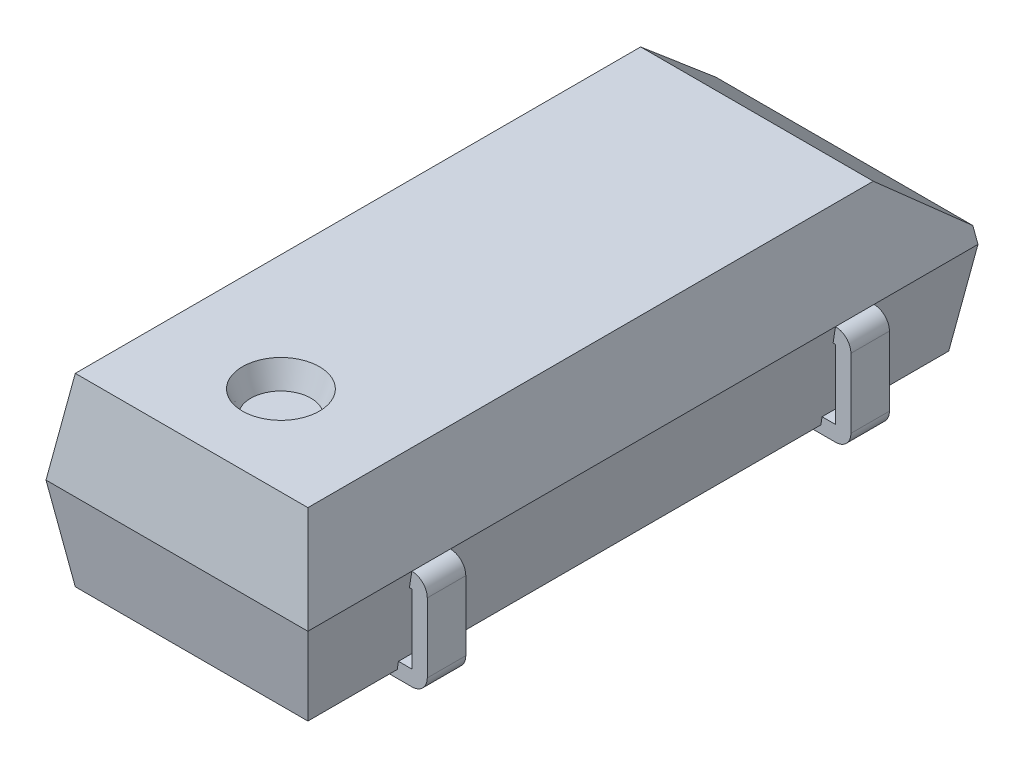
ISO-10303-21;
HEADER;
FILE_DESCRIPTION(('STEP AP214'),'2;1');
FILE_NAME('part.step','',(''),(''),'','','');
FILE_SCHEMA(('AUTOMOTIVE_DESIGN { 1 0 10303 214 1 1 1 1 }'));
ENDSEC;
DATA;
#1=APPLICATION_CONTEXT('core data for automotive mechanical design processes');
#2=APPLICATION_PROTOCOL_DEFINITION('international standard','automotive_design',2000,#1);
#3=PRODUCT_CONTEXT('',#1,'mechanical');
#4=PRODUCT('Part','Part','',(#3));
#5=PRODUCT_RELATED_PRODUCT_CATEGORY('part','',(#4));
#6=PRODUCT_DEFINITION_FORMATION('','',#4);
#7=PRODUCT_DEFINITION_CONTEXT('part definition',#1,'design');
#8=PRODUCT_DEFINITION('design','',#6,#7);
#9=PRODUCT_DEFINITION_SHAPE('','',#8);
#10=(LENGTH_UNIT() NAMED_UNIT(*) SI_UNIT(.MILLI.,.METRE.));
#11=(NAMED_UNIT(*) PLANE_ANGLE_UNIT() SI_UNIT($,.RADIAN.));
#12=(NAMED_UNIT(*) SI_UNIT($,.STERADIAN.) SOLID_ANGLE_UNIT());
#13=UNCERTAINTY_MEASURE_WITH_UNIT(LENGTH_MEASURE(1.E-05),#10,'distance_accuracy_value','');
#14=(GEOMETRIC_REPRESENTATION_CONTEXT(3) GLOBAL_UNCERTAINTY_ASSIGNED_CONTEXT((#13)) GLOBAL_UNIT_ASSIGNED_CONTEXT((#10,
#11,#12)) REPRESENTATION_CONTEXT('',''));
#15=CARTESIAN_POINT('',(0.,0.,0.));
#16=DIRECTION('',(0.,0.,1.));
#17=DIRECTION('',(1.,0.,0.));
#18=AXIS2_PLACEMENT_3D('',#15,#16,#17);
#19=CARTESIAN_POINT('',(-1.7,1.3,4.35));
#20=DIRECTION('',(-0.987688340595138,-0.156434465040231,0.));
#21=DIRECTION('',(0.156434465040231,-0.987688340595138,0.));
#22=AXIS2_PLACEMENT_3D('',#19,#20,#21);
#23=PLANE('',#22);
#24=DIRECTION('',(0.,0.,1.));
#25=VECTOR('',#24,1.);
#26=CARTESIAN_POINT('',(-1.50993867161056,0.1,4.35));
#27=LINE('',#26,#25);
#28=CARTESIAN_POINT('',(-1.50993867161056,0.1,-4.15993867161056));
#29=VERTEX_POINT('',#28);
#30=CARTESIAN_POINT('',(-1.50993867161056,0.1,-3.));
#31=VERTEX_POINT('',#30);
#32=EDGE_CURVE('E759',#29,#31,#27,.T.);
#33=ORIENTED_EDGE('',*,*,#32,.T.);
#34=DIRECTION('',(-0.156434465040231,0.987688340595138,0.));
#35=VECTOR('',#34,1.);
#36=CARTESIAN_POINT('',(-1.7,1.3,-3.));
#37=LINE('',#36,#35);
#38=CARTESIAN_POINT('',(-1.52577711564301,0.2,-3.));
#39=VERTEX_POINT('',#38);
#40=EDGE_CURVE('E558',#31,#39,#37,.T.);
#41=ORIENTED_EDGE('',*,*,#40,.T.);
#42=DIRECTION('',(0.,0.,-1.));
#43=VECTOR('',#42,1.);
#44=CARTESIAN_POINT('',(-1.52577711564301,0.2,4.35));
#45=LINE('',#44,#43);
#46=CARTESIAN_POINT('',(-1.52577711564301,0.2,-2.5));
#47=VERTEX_POINT('',#46);
#48=EDGE_CURVE('E871',#47,#39,#45,.T.);
#49=ORIENTED_EDGE('',*,*,#48,.F.);
#50=DIRECTION('',(-0.156434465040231,0.987688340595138,0.));
#51=VECTOR('',#50,1.);
#52=CARTESIAN_POINT('',(-1.7,1.3,-2.5));
#53=LINE('',#52,#51);
#54=CARTESIAN_POINT('',(-1.50993867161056,0.1,-2.5));
#55=VERTEX_POINT('',#54);
#56=EDGE_CURVE('E553',#55,#47,#53,.T.);
#57=ORIENTED_EDGE('',*,*,#56,.F.);
#58=CARTESIAN_POINT('',(-1.50993867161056,0.1,2.5));
#59=VERTEX_POINT('',#58);
#60=EDGE_CURVE('E764',#55,#59,#27,.T.);
#61=ORIENTED_EDGE('',*,*,#60,.T.);
#62=DIRECTION('',(0.156434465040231,-0.987688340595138,0.));
#63=VECTOR('',#62,1.);
#64=CARTESIAN_POINT('',(-1.7,1.3,2.5));
#65=LINE('',#64,#63);
#66=CARTESIAN_POINT('',(-1.52577711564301,0.2,2.5));
#67=VERTEX_POINT('',#66);
#68=EDGE_CURVE('E732',#67,#59,#65,.T.);
#69=ORIENTED_EDGE('',*,*,#68,.F.);
#70=DIRECTION('',(0.,0.,1.));
#71=VECTOR('',#70,1.);
#72=CARTESIAN_POINT('',(-1.52577711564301,0.2,4.35));
#73=LINE('',#72,#71);
#74=CARTESIAN_POINT('',(-1.52577711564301,0.2,3.));
#75=VERTEX_POINT('',#74);
#76=EDGE_CURVE('E831',#67,#75,#73,.T.);
#77=ORIENTED_EDGE('',*,*,#76,.T.);
#78=DIRECTION('',(0.156434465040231,-0.987688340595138,0.));
#79=VECTOR('',#78,1.);
#80=CARTESIAN_POINT('',(-1.7,1.3,3.));
#81=LINE('',#80,#79);
#82=CARTESIAN_POINT('',(-1.50993867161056,0.1,3.));
#83=VERTEX_POINT('',#82);
#84=EDGE_CURVE('E737',#75,#83,#81,.T.);
#85=ORIENTED_EDGE('',*,*,#84,.T.);
#86=CARTESIAN_POINT('',(-1.50993867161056,0.1,4.15993867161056));
#87=VERTEX_POINT('',#86);
#88=EDGE_CURVE('E765',#83,#87,#27,.T.);
#89=ORIENTED_EDGE('',*,*,#88,.T.);
#90=DIRECTION('',(-0.154554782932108,0.975820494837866,0.154554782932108));
#91=VECTOR('',#90,1.);
#92=CARTESIAN_POINT('',(-1.7,1.3,4.35));
#93=LINE('',#92,#91);
#94=CARTESIAN_POINT('',(-1.7,1.3,4.35));
#95=VERTEX_POINT('',#94);
#96=EDGE_CURVE('E747',#87,#95,#93,.T.);
#97=ORIENTED_EDGE('',*,*,#96,.T.);
#98=DIRECTION('',(0.,0.,1.));
#99=VECTOR('',#98,1.);
#100=CARTESIAN_POINT('',(-1.7,1.3,4.35));
#101=LINE('',#100,#99);
#102=CARTESIAN_POINT('',(-1.7,1.3,3.));
#103=VERTEX_POINT('',#102);
#104=EDGE_CURVE('E745',#103,#95,#101,.T.);
#105=ORIENTED_EDGE('',*,*,#104,.F.);
#106=CARTESIAN_POINT('',(-1.66832311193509,1.1,3.));
#107=VERTEX_POINT('',#106);
#108=EDGE_CURVE('E740',#103,#107,#81,.T.);
#109=ORIENTED_EDGE('',*,*,#108,.T.);
#110=DIRECTION('',(0.,0.,-1.));
#111=VECTOR('',#110,1.);
#112=CARTESIAN_POINT('',(-1.66832311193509,1.1,4.35));
#113=LINE('',#112,#111);
#114=CARTESIAN_POINT('',(-1.66832311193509,1.1,2.5));
#115=VERTEX_POINT('',#114);
#116=EDGE_CURVE('E833',#107,#115,#113,.T.);
#117=ORIENTED_EDGE('',*,*,#116,.T.);
#118=CARTESIAN_POINT('',(-1.7,1.3,2.5));
#119=VERTEX_POINT('',#118);
#120=EDGE_CURVE('E736',#119,#115,#65,.T.);
#121=ORIENTED_EDGE('',*,*,#120,.F.);
#122=CARTESIAN_POINT('',(-1.7,1.3,-2.5));
#123=VERTEX_POINT('',#122);
#124=EDGE_CURVE('E783',#123,#119,#101,.T.);
#125=ORIENTED_EDGE('',*,*,#124,.F.);
#126=CARTESIAN_POINT('',(-1.66832311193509,1.1,-2.5));
#127=VERTEX_POINT('',#126);
#128=EDGE_CURVE('E557',#127,#123,#53,.T.);
#129=ORIENTED_EDGE('',*,*,#128,.F.);
#130=DIRECTION('',(0.,0.,1.));
#131=VECTOR('',#130,1.);
#132=CARTESIAN_POINT('',(-1.66832311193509,1.1,4.35));
#133=LINE('',#132,#131);
#134=CARTESIAN_POINT('',(-1.66832311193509,1.1,-3.));
#135=VERTEX_POINT('',#134);
#136=EDGE_CURVE('E868',#135,#127,#133,.T.);
#137=ORIENTED_EDGE('',*,*,#136,.F.);
#138=CARTESIAN_POINT('',(-1.7,1.3,-3.));
#139=VERTEX_POINT('',#138);
#140=EDGE_CURVE('E561',#135,#139,#37,.T.);
#141=ORIENTED_EDGE('',*,*,#140,.T.);
#142=CARTESIAN_POINT('',(-1.7,1.3,-4.35));
#143=VERTEX_POINT('',#142);
#144=EDGE_CURVE('E778',#143,#139,#101,.T.);
#145=ORIENTED_EDGE('',*,*,#144,.F.);
#146=DIRECTION('',(-0.154554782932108,0.975820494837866,-0.154554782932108));
#147=VECTOR('',#146,1.);
#148=CARTESIAN_POINT('',(-1.7,1.3,-4.35));
#149=LINE('',#148,#147);
#150=EDGE_CURVE('E741',#29,#143,#149,.T.);
#151=ORIENTED_EDGE('',*,*,#150,.F.);
#152=EDGE_LOOP('',(#33,#41,#49,#57,#61,#69,#77,#85,#89,#97,#105,#109,#117,#121,#125,#129,#137,
#141,#145,#151));
#153=FACE_BOUND('',#152,.T.);
#154=ADVANCED_FACE('F37',(#153),#23,.T.);
#155=CARTESIAN_POINT('',(-1.7,0.1,-4.35));
#156=DIRECTION('',(0.,-1.,0.));
#157=DIRECTION('',(0.,0.,-1.));
#158=AXIS2_PLACEMENT_3D('',#155,#156,#157);
#159=PLANE('',#158);
#160=DIRECTION('',(1.,0.,0.));
#161=VECTOR('',#160,1.);
#162=CARTESIAN_POINT('',(-1.7,0.1,-3.));
#163=LINE('',#162,#161);
#164=CARTESIAN_POINT('',(1.,0.1,-3.));
#165=VERTEX_POINT('',#164);
#166=CARTESIAN_POINT('',(1.50993867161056,0.1,-3.));
#167=VERTEX_POINT('',#166);
#168=EDGE_CURVE('E466',#165,#167,#163,.T.);
#169=ORIENTED_EDGE('',*,*,#168,.F.);
#170=DIRECTION('',(0.,0.,-1.));
#171=VECTOR('',#170,1.);
#172=CARTESIAN_POINT('',(1.,0.1,-4.35));
#173=LINE('',#172,#171);
#174=CARTESIAN_POINT('',(1.,0.1,-2.5));
#175=VERTEX_POINT('',#174);
#176=EDGE_CURVE('E889',#175,#165,#173,.T.);
#177=ORIENTED_EDGE('',*,*,#176,.F.);
#178=DIRECTION('',(1.,0.,0.));
#179=VECTOR('',#178,1.);
#180=CARTESIAN_POINT('',(-1.7,0.1,-2.5));
#181=LINE('',#180,#179);
#182=CARTESIAN_POINT('',(1.50993867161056,0.1,-2.5));
#183=VERTEX_POINT('',#182);
#184=EDGE_CURVE('E381',#175,#183,#181,.T.);
#185=ORIENTED_EDGE('',*,*,#184,.T.);
#186=DIRECTION('',(0.,0.,-1.));
#187=VECTOR('',#186,1.);
#188=CARTESIAN_POINT('',(1.50993867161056,0.1,4.35));
#189=LINE('',#188,#187);
#190=CARTESIAN_POINT('',(1.50993867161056,0.1,2.5));
#191=VERTEX_POINT('',#190);
#192=EDGE_CURVE('E773',#191,#183,#189,.T.);
#193=ORIENTED_EDGE('',*,*,#192,.F.);
#194=DIRECTION('',(-1.,0.,0.));
#195=VECTOR('',#194,1.);
#196=CARTESIAN_POINT('',(-1.7,0.1,2.5));
#197=LINE('',#196,#195);
#198=CARTESIAN_POINT('',(1.,0.1,2.5));
#199=VERTEX_POINT('',#198);
#200=EDGE_CURVE('E643',#191,#199,#197,.T.);
#201=ORIENTED_EDGE('',*,*,#200,.T.);
#202=DIRECTION('',(0.,0.,1.));
#203=VECTOR('',#202,1.);
#204=CARTESIAN_POINT('',(1.,0.1,-4.35));
#205=LINE('',#204,#203);
#206=CARTESIAN_POINT('',(1.,0.1,3.));
#207=VERTEX_POINT('',#206);
#208=EDGE_CURVE('E853',#199,#207,#205,.T.);
#209=ORIENTED_EDGE('',*,*,#208,.T.);
#210=DIRECTION('',(-1.,0.,0.));
#211=VECTOR('',#210,1.);
#212=CARTESIAN_POINT('',(-1.7,0.1,3.));
#213=LINE('',#212,#211);
#214=CARTESIAN_POINT('',(1.50993867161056,0.1,3.));
#215=VERTEX_POINT('',#214);
#216=EDGE_CURVE('E647',#215,#207,#213,.T.);
#217=ORIENTED_EDGE('',*,*,#216,.F.);
#218=CARTESIAN_POINT('',(1.50993867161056,0.1,4.15993867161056));
#219=VERTEX_POINT('',#218);
#220=EDGE_CURVE('E769',#219,#215,#189,.T.);
#221=ORIENTED_EDGE('',*,*,#220,.F.);
#222=DIRECTION('',(1.,0.,0.));
#223=VECTOR('',#222,1.);
#224=CARTESIAN_POINT('',(-1.7,0.1,4.15993867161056));
#225=LINE('',#224,#223);
#226=EDGE_CURVE('E763',#87,#219,#225,.T.);
#227=ORIENTED_EDGE('',*,*,#226,.F.);
#228=ORIENTED_EDGE('',*,*,#88,.F.);
#229=DIRECTION('',(1.,0.,0.));
#230=VECTOR('',#229,1.);
#231=CARTESIAN_POINT('',(-1.7,0.1,3.));
#232=LINE('',#231,#230);
#233=CARTESIAN_POINT('',(-1.,0.1,3.));
#234=VERTEX_POINT('',#233);
#235=EDGE_CURVE('E828',#83,#234,#232,.T.);
#236=ORIENTED_EDGE('',*,*,#235,.T.);
#237=DIRECTION('',(0.,0.,-1.));
#238=VECTOR('',#237,1.);
#239=CARTESIAN_POINT('',(-1.,0.1,-4.35));
#240=LINE('',#239,#238);
#241=CARTESIAN_POINT('',(-1.,0.1,2.5));
#242=VERTEX_POINT('',#241);
#243=EDGE_CURVE('E825',#234,#242,#240,.T.);
#244=ORIENTED_EDGE('',*,*,#243,.T.);
#245=DIRECTION('',(1.,0.,0.));
#246=VECTOR('',#245,1.);
#247=CARTESIAN_POINT('',(-1.7,0.1,2.5));
#248=LINE('',#247,#246);
#249=EDGE_CURVE('E802',#59,#242,#248,.T.);
#250=ORIENTED_EDGE('',*,*,#249,.F.);
#251=ORIENTED_EDGE('',*,*,#60,.F.);
#252=DIRECTION('',(-1.,0.,0.));
#253=VECTOR('',#252,1.);
#254=CARTESIAN_POINT('',(-1.7,0.1,-2.5));
#255=LINE('',#254,#253);
#256=CARTESIAN_POINT('',(-1.,0.1,-2.5));
#257=VERTEX_POINT('',#256);
#258=EDGE_CURVE('E857',#257,#55,#255,.T.);
#259=ORIENTED_EDGE('',*,*,#258,.F.);
#260=DIRECTION('',(0.,0.,1.));
#261=VECTOR('',#260,1.);
#262=CARTESIAN_POINT('',(-1.,0.1,-4.35));
#263=LINE('',#262,#261);
#264=CARTESIAN_POINT('',(-1.,0.1,-3.));
#265=VERTEX_POINT('',#264);
#266=EDGE_CURVE('E861',#265,#257,#263,.T.);
#267=ORIENTED_EDGE('',*,*,#266,.F.);
#268=DIRECTION('',(-1.,0.,0.));
#269=VECTOR('',#268,1.);
#270=CARTESIAN_POINT('',(-1.7,0.1,-3.));
#271=LINE('',#270,#269);
#272=EDGE_CURVE('E865',#265,#31,#271,.T.);
#273=ORIENTED_EDGE('',*,*,#272,.T.);
#274=ORIENTED_EDGE('',*,*,#32,.F.);
#275=DIRECTION('',(-1.,0.,0.));
#276=VECTOR('',#275,1.);
#277=CARTESIAN_POINT('',(-1.7,0.1,-4.15993867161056));
#278=LINE('',#277,#276);
#279=CARTESIAN_POINT('',(1.50993867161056,0.1,-4.15993867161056));
#280=VERTEX_POINT('',#279);
#281=EDGE_CURVE('E752',#280,#29,#278,.T.);
#282=ORIENTED_EDGE('',*,*,#281,.F.);
#283=EDGE_CURVE('E774',#167,#280,#189,.T.);
#284=ORIENTED_EDGE('',*,*,#283,.F.);
#285=EDGE_LOOP('',(#169,#177,#185,#193,#201,#209,#217,#221,#227,#228,#236,#244,#250,#251,#259,
#267,#273,#274,#282,#284));
#286=FACE_BOUND('',#285,.T.);
#287=ADVANCED_FACE('F921',(#286),#159,.T.);
#288=CARTESIAN_POINT('',(-1.7,1.3,4.35));
#289=DIRECTION('',(-0.987688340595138,0.156434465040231,0.));
#290=DIRECTION('',(-0.156434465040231,-0.987688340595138,0.));
#291=AXIS2_PLACEMENT_3D('',#288,#289,#290);
#292=PLANE('',#291);
#293=DIRECTION('',(0.,0.,-1.));
#294=VECTOR('',#293,1.);
#295=CARTESIAN_POINT('',(-1.50993867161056,2.5,-4.35));
#296=LINE('',#295,#294);
#297=CARTESIAN_POINT('',(-1.50993867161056,2.5,-3.18016767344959));
#298=VERTEX_POINT('',#297);
#299=CARTESIAN_POINT('',(-1.50993867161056,2.5,4.15993867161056));
#300=VERTEX_POINT('',#299);
#301=EDGE_CURVE('E797',#298,#300,#296,.F.);
#302=ORIENTED_EDGE('',*,*,#301,.F.);
#303=DIRECTION('',(0.103353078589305,0.652545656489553,0.750667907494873));
#304=VECTOR('',#303,1.);
#305=CARTESIAN_POINT('',(-1.51196887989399,2.48718176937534,-3.19491336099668));
#306=LINE('',#305,#304);
#307=CARTESIAN_POINT('',(-1.66637313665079,1.51231165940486,-4.31637313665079));
#308=VERTEX_POINT('',#307);
#309=EDGE_CURVE('E60',#298,#308,#306,.F.);
#310=ORIENTED_EDGE('',*,*,#309,.T.);
#311=DIRECTION('',(-0.154554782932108,-0.975820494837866,-0.154554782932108));
#312=VECTOR('',#311,1.);
#313=CARTESIAN_POINT('',(-1.49218152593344,2.61211420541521,-4.14218152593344));
#314=LINE('',#313,#312);
#315=EDGE_CURVE('E804',#308,#143,#314,.T.);
#316=ORIENTED_EDGE('',*,*,#315,.T.);
#317=ORIENTED_EDGE('',*,*,#144,.T.);
#318=DIRECTION('',(0.,0.,1.));
#319=VECTOR('',#318,1.);
#320=CARTESIAN_POINT('',(-1.7,1.3,-3.));
#321=LINE('',#320,#319);
#322=EDGE_CURVE('E533',#139,#123,#321,.T.);
#323=ORIENTED_EDGE('',*,*,#322,.T.);
#324=ORIENTED_EDGE('',*,*,#124,.T.);
#325=DIRECTION('',(0.,0.,-1.));
#326=VECTOR('',#325,1.);
#327=CARTESIAN_POINT('',(-1.7,1.3,3.));
#328=LINE('',#327,#326);
#329=EDGE_CURVE('E724',#103,#119,#328,.T.);
#330=ORIENTED_EDGE('',*,*,#329,.F.);
#331=ORIENTED_EDGE('',*,*,#104,.T.);
#332=DIRECTION('',(-0.154554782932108,-0.975820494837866,0.154554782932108));
#333=VECTOR('',#332,1.);
#334=CARTESIAN_POINT('',(-1.7,1.3,4.35));
#335=LINE('',#334,#333);
#336=EDGE_CURVE('E798',#300,#95,#335,.T.);
#337=ORIENTED_EDGE('',*,*,#336,.F.);
#338=EDGE_LOOP('',(#302,#310,#316,#317,#323,#324,#330,#331,#337));
#339=FACE_BOUND('',#338,.T.);
#340=ADVANCED_FACE('F1091',(#339),#292,.T.);
#341=CARTESIAN_POINT('',(-1.7,1.3,4.35));
#342=DIRECTION('',(0.,0.156434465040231,0.987688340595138));
#343=DIRECTION('',(0.,-0.987688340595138,0.156434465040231));
#344=AXIS2_PLACEMENT_3D('',#341,#342,#343);
#345=PLANE('',#344);
#346=DIRECTION('',(1.,0.,0.));
#347=VECTOR('',#346,1.);
#348=CARTESIAN_POINT('',(-1.7,1.3,4.35));
#349=LINE('',#348,#347);
#350=CARTESIAN_POINT('',(1.7,1.3,4.35));
#351=VERTEX_POINT('',#350);
#352=EDGE_CURVE('E782',#95,#351,#349,.T.);
#353=ORIENTED_EDGE('',*,*,#352,.T.);
#354=DIRECTION('',(0.154554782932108,-0.975820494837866,0.154554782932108));
#355=VECTOR('',#354,1.);
#356=CARTESIAN_POINT('',(1.7,1.3,4.35));
#357=LINE('',#356,#355);
#358=CARTESIAN_POINT('',(1.50993867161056,2.5,4.15993867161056));
#359=VERTEX_POINT('',#358);
#360=EDGE_CURVE('E803',#359,#351,#357,.T.);
#361=ORIENTED_EDGE('',*,*,#360,.F.);
#362=DIRECTION('',(-1.,0.,0.));
#363=VECTOR('',#362,1.);
#364=CARTESIAN_POINT('',(-1.7,2.5,4.15993867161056));
#365=LINE('',#364,#363);
#366=EDGE_CURVE('E816',#300,#359,#365,.F.);
#367=ORIENTED_EDGE('',*,*,#366,.F.);
#368=ORIENTED_EDGE('',*,*,#336,.T.);
#369=EDGE_LOOP('',(#353,#361,#367,#368));
#370=FACE_BOUND('',#369,.T.);
#371=ADVANCED_FACE('F39',(#370),#345,.T.);
#372=CARTESIAN_POINT('',(1.7,1.3,4.35));
#373=DIRECTION('',(0.987688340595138,0.156434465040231,0.));
#374=DIRECTION('',(-0.156434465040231,0.987688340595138,0.));
#375=AXIS2_PLACEMENT_3D('',#372,#373,#374);
#376=PLANE('',#375);
#377=DIRECTION('',(0.154554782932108,-0.975820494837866,-0.154554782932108));
#378=VECTOR('',#377,1.);
#379=CARTESIAN_POINT('',(1.61878358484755,1.81278026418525,-4.26878358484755));
#380=LINE('',#379,#378);
#381=CARTESIAN_POINT('',(1.66637313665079,1.51231165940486,-4.31637313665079));
#382=VERTEX_POINT('',#381);
#383=CARTESIAN_POINT('',(1.7,1.3,-4.35));
#384=VERTEX_POINT('',#383);
#385=EDGE_CURVE('E807',#382,#384,#380,.T.);
#386=ORIENTED_EDGE('',*,*,#385,.F.);
#387=DIRECTION('',(0.103353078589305,-0.652545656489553,-0.750667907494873));
#388=VECTOR('',#387,1.);
#389=CARTESIAN_POINT('',(1.47565055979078,2.71648661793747,-2.93112830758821));
#390=LINE('',#389,#388);
#391=CARTESIAN_POINT('',(1.50993867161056,2.5,-3.18016767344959));
#392=VERTEX_POINT('',#391);
#393=EDGE_CURVE('E11',#382,#392,#390,.F.);
#394=ORIENTED_EDGE('',*,*,#393,.T.);
#395=DIRECTION('',(0.,0.,1.));
#396=VECTOR('',#395,1.);
#397=CARTESIAN_POINT('',(1.50993867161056,2.5,-4.35));
#398=LINE('',#397,#396);
#399=EDGE_CURVE('E808',#359,#392,#398,.F.);
#400=ORIENTED_EDGE('',*,*,#399,.F.);
#401=ORIENTED_EDGE('',*,*,#360,.T.);
#402=DIRECTION('',(0.,0.,-1.));
#403=VECTOR('',#402,1.);
#404=CARTESIAN_POINT('',(1.7,1.3,4.35));
#405=LINE('',#404,#403);
#406=CARTESIAN_POINT('',(1.7,1.3,3.));
#407=VERTEX_POINT('',#406);
#408=EDGE_CURVE('E788',#351,#407,#405,.T.);
#409=ORIENTED_EDGE('',*,*,#408,.T.);
#410=DIRECTION('',(0.,0.,-1.));
#411=VECTOR('',#410,1.);
#412=CARTESIAN_POINT('',(1.7,1.3,3.));
#413=LINE('',#412,#411);
#414=CARTESIAN_POINT('',(1.7,1.3,2.5));
#415=VERTEX_POINT('',#414);
#416=EDGE_CURVE('E619',#407,#415,#413,.T.);
#417=ORIENTED_EDGE('',*,*,#416,.T.);
#418=CARTESIAN_POINT('',(1.7,1.3,-2.5));
#419=VERTEX_POINT('',#418);
#420=EDGE_CURVE('E793',#415,#419,#405,.T.);
#421=ORIENTED_EDGE('',*,*,#420,.T.);
#422=DIRECTION('',(0.,0.,1.));
#423=VECTOR('',#422,1.);
#424=CARTESIAN_POINT('',(1.7,1.3,-3.));
#425=LINE('',#424,#423);
#426=CARTESIAN_POINT('',(1.7,1.3,-3.));
#427=VERTEX_POINT('',#426);
#428=EDGE_CURVE('E382',#427,#419,#425,.T.);
#429=ORIENTED_EDGE('',*,*,#428,.F.);
#430=EDGE_CURVE('E787',#427,#384,#405,.T.);
#431=ORIENTED_EDGE('',*,*,#430,.T.);
#432=EDGE_LOOP('',(#386,#394,#400,#401,#409,#417,#421,#429,#431));
#433=FACE_BOUND('',#432,.T.);
#434=ADVANCED_FACE('F1020',(#433),#376,.T.);
#435=CARTESIAN_POINT('',(-1.7,1.3,-4.35));
#436=DIRECTION('',(0.,0.156434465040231,-0.987688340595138));
#437=DIRECTION('',(0.,0.987688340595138,0.156434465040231));
#438=AXIS2_PLACEMENT_3D('',#435,#436,#437);
#439=PLANE('',#438);
#440=ORIENTED_EDGE('',*,*,#315,.F.);
#441=DIRECTION('',(-1.,0.,0.));
#442=VECTOR('',#441,1.);
#443=CARTESIAN_POINT('',(-1.7,1.51231165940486,-4.31637313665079));
#444=LINE('',#443,#442);
#445=EDGE_CURVE('E46',#308,#382,#444,.F.);
#446=ORIENTED_EDGE('',*,*,#445,.T.);
#447=ORIENTED_EDGE('',*,*,#385,.T.);
#448=DIRECTION('',(-1.,0.,0.));
#449=VECTOR('',#448,1.);
#450=CARTESIAN_POINT('',(-1.7,1.3,-4.35));
#451=LINE('',#450,#449);
#452=EDGE_CURVE('E792',#384,#143,#451,.T.);
#453=ORIENTED_EDGE('',*,*,#452,.T.);
#454=EDGE_LOOP('',(#440,#446,#447,#453));
#455=FACE_BOUND('',#454,.T.);
#456=ADVANCED_FACE('F1136',(#455),#439,.T.);
#457=CARTESIAN_POINT('',(-1.7,2.5,-4.35));
#458=DIRECTION('',(0.,-1.,0.));
#459=DIRECTION('',(0.,0.,-1.));
#460=AXIS2_PLACEMENT_3D('',#457,#458,#459);
#461=PLANE('',#460);
#462=CARTESIAN_POINT('',(0.,2.5,3.));
#463=DIRECTION('',(0.,1.,0.));
#464=DIRECTION('',(0.,0.,1.));
#465=AXIS2_PLACEMENT_3D('',#462,#463,#464);
#466=CIRCLE('',#465,0.5);
#467=CARTESIAN_POINT('',(0.,2.5,3.5));
#468=VERTEX_POINT('',#467);
#469=EDGE_CURVE('E393',#468,#468,#466,.T.);
#470=ORIENTED_EDGE('',*,*,#469,.F.);
#471=EDGE_LOOP('',(#470));
#472=FACE_BOUND('',#471,.T.);
#473=ORIENTED_EDGE('',*,*,#399,.T.);
#474=DIRECTION('',(-1.,0.,0.));
#475=VECTOR('',#474,1.);
#476=CARTESIAN_POINT('',(-1.7,2.5,-3.18016767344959));
#477=LINE('',#476,#475);
#478=EDGE_CURVE('E892',#392,#298,#477,.T.);
#479=ORIENTED_EDGE('',*,*,#478,.T.);
#480=ORIENTED_EDGE('',*,*,#301,.T.);
#481=ORIENTED_EDGE('',*,*,#366,.T.);
#482=EDGE_LOOP('',(#473,#479,#480,#481));
#483=FACE_BOUND('',#482,.T.);
#484=ADVANCED_FACE('F1101',(#472,#483),#461,.F.);
#485=CARTESIAN_POINT('',(-1.7,1.3,-4.35));
#486=DIRECTION('',(0.,-0.156434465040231,-0.987688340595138));
#487=DIRECTION('',(0.,0.987688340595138,-0.156434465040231));
#488=AXIS2_PLACEMENT_3D('',#485,#486,#487);
#489=PLANE('',#488);
#490=ORIENTED_EDGE('',*,*,#452,.F.);
#491=DIRECTION('',(0.154554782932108,0.975820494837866,-0.154554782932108));
#492=VECTOR('',#491,1.);
#493=CARTESIAN_POINT('',(1.49218152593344,-0.0121142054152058,-4.14218152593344));
#494=LINE('',#493,#492);
#495=EDGE_CURVE('E746',#280,#384,#494,.T.);
#496=ORIENTED_EDGE('',*,*,#495,.F.);
#497=ORIENTED_EDGE('',*,*,#281,.T.);
#498=ORIENTED_EDGE('',*,*,#150,.T.);
#499=EDGE_LOOP('',(#490,#496,#497,#498));
#500=FACE_BOUND('',#499,.T.);
#501=ADVANCED_FACE('F919',(#500),#489,.T.);
#502=CARTESIAN_POINT('',(1.7,1.3,4.35));
#503=DIRECTION('',(0.987688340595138,-0.156434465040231,0.));
#504=DIRECTION('',(0.156434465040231,0.987688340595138,0.));
#505=AXIS2_PLACEMENT_3D('',#502,#503,#504);
#506=PLANE('',#505);
#507=DIRECTION('',(0.156434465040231,0.987688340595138,0.));
#508=VECTOR('',#507,1.);
#509=CARTESIAN_POINT('',(1.7,1.3,-3.));
#510=LINE('',#509,#508);
#511=CARTESIAN_POINT('',(1.52577711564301,0.2,-3.));
#512=VERTEX_POINT('',#511);
#513=EDGE_CURVE('E884',#167,#512,#510,.T.);
#514=ORIENTED_EDGE('',*,*,#513,.F.);
#515=ORIENTED_EDGE('',*,*,#283,.T.);
#516=ORIENTED_EDGE('',*,*,#495,.T.);
#517=ORIENTED_EDGE('',*,*,#430,.F.);
#518=CARTESIAN_POINT('',(1.66832311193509,1.1,-3.));
#519=VERTEX_POINT('',#518);
#520=EDGE_CURVE('E881',#519,#427,#510,.T.);
#521=ORIENTED_EDGE('',*,*,#520,.F.);
#522=DIRECTION('',(0.,0.,-1.));
#523=VECTOR('',#522,1.);
#524=CARTESIAN_POINT('',(1.66832311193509,1.1,4.35));
#525=LINE('',#524,#523);
#526=CARTESIAN_POINT('',(1.66832311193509,1.1,-2.5));
#527=VERTEX_POINT('',#526);
#528=EDGE_CURVE('E877',#527,#519,#525,.T.);
#529=ORIENTED_EDGE('',*,*,#528,.F.);
#530=DIRECTION('',(0.156434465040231,0.987688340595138,0.));
#531=VECTOR('',#530,1.);
#532=CARTESIAN_POINT('',(1.7,1.3,-2.5));
#533=LINE('',#532,#531);
#534=EDGE_CURVE('E366',#527,#419,#533,.T.);
#535=ORIENTED_EDGE('',*,*,#534,.T.);
#536=ORIENTED_EDGE('',*,*,#420,.F.);
#537=DIRECTION('',(-0.156434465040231,-0.987688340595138,0.));
#538=VECTOR('',#537,1.);
#539=CARTESIAN_POINT('',(1.7,1.3,2.5));
#540=LINE('',#539,#538);
#541=CARTESIAN_POINT('',(1.66832311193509,1.1,2.5));
#542=VERTEX_POINT('',#541);
#543=EDGE_CURVE('E841',#415,#542,#540,.T.);
#544=ORIENTED_EDGE('',*,*,#543,.T.);
#545=DIRECTION('',(0.,0.,1.));
#546=VECTOR('',#545,1.);
#547=CARTESIAN_POINT('',(1.66832311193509,1.1,4.35));
#548=LINE('',#547,#546);
#549=CARTESIAN_POINT('',(1.66832311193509,1.1,3.));
#550=VERTEX_POINT('',#549);
#551=EDGE_CURVE('E849',#542,#550,#548,.T.);
#552=ORIENTED_EDGE('',*,*,#551,.T.);
#553=DIRECTION('',(-0.156434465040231,-0.987688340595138,0.));
#554=VECTOR('',#553,1.);
#555=CARTESIAN_POINT('',(1.7,1.3,3.));
#556=LINE('',#555,#554);
#557=EDGE_CURVE('E848',#407,#550,#556,.T.);
#558=ORIENTED_EDGE('',*,*,#557,.F.);
#559=ORIENTED_EDGE('',*,*,#408,.F.);
#560=DIRECTION('',(0.154554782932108,0.975820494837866,0.154554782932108));
#561=VECTOR('',#560,1.);
#562=CARTESIAN_POINT('',(1.61878358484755,0.787219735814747,4.26878358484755));
#563=LINE('',#562,#561);
#564=EDGE_CURVE('E751',#219,#351,#563,.T.);
#565=ORIENTED_EDGE('',*,*,#564,.F.);
#566=ORIENTED_EDGE('',*,*,#220,.T.);
#567=CARTESIAN_POINT('',(1.52577711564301,0.2,3.));
#568=VERTEX_POINT('',#567);
#569=EDGE_CURVE('E845',#568,#215,#556,.T.);
#570=ORIENTED_EDGE('',*,*,#569,.F.);
#571=DIRECTION('',(0.,0.,-1.));
#572=VECTOR('',#571,1.);
#573=CARTESIAN_POINT('',(1.52577711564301,0.2,4.35));
#574=LINE('',#573,#572);
#575=CARTESIAN_POINT('',(1.52577711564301,0.2,2.5));
#576=VERTEX_POINT('',#575);
#577=EDGE_CURVE('E840',#568,#576,#574,.T.);
#578=ORIENTED_EDGE('',*,*,#577,.T.);
#579=EDGE_CURVE('E836',#576,#191,#540,.T.);
#580=ORIENTED_EDGE('',*,*,#579,.T.);
#581=ORIENTED_EDGE('',*,*,#192,.T.);
#582=CARTESIAN_POINT('',(1.52577711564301,0.2,-2.5));
#583=VERTEX_POINT('',#582);
#584=EDGE_CURVE('E878',#183,#583,#533,.T.);
#585=ORIENTED_EDGE('',*,*,#584,.T.);
#586=DIRECTION('',(0.,0.,1.));
#587=VECTOR('',#586,1.);
#588=CARTESIAN_POINT('',(1.52577711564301,0.2,4.35));
#589=LINE('',#588,#587);
#590=EDGE_CURVE('E885',#512,#583,#589,.T.);
#591=ORIENTED_EDGE('',*,*,#590,.F.);
#592=EDGE_LOOP('',(#514,#515,#516,#517,#521,#529,#535,#536,#544,#552,#558,#559,#565,#566,#570,
#578,#580,#581,#585,#591));
#593=FACE_BOUND('',#592,.T.);
#594=ADVANCED_FACE('F911',(#593),#506,.T.);
#595=CARTESIAN_POINT('',(-1.7,1.3,4.35));
#596=DIRECTION('',(0.,-0.156434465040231,0.987688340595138));
#597=DIRECTION('',(0.,-0.987688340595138,-0.156434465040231));
#598=AXIS2_PLACEMENT_3D('',#595,#596,#597);
#599=PLANE('',#598);
#600=ORIENTED_EDGE('',*,*,#352,.F.);
#601=ORIENTED_EDGE('',*,*,#96,.F.);
#602=ORIENTED_EDGE('',*,*,#226,.T.);
#603=ORIENTED_EDGE('',*,*,#564,.T.);
#604=EDGE_LOOP('',(#600,#601,#602,#603));
#605=FACE_BOUND('',#604,.T.);
#606=ADVANCED_FACE('F1095',(#605),#599,.T.);
#607=CARTESIAN_POINT('',(-1.7,0.2,3.));
#608=DIRECTION('',(-1.,0.,0.));
#609=DIRECTION('',(0.,-1.,0.));
#610=AXIS2_PLACEMENT_3D('',#607,#608,#609);
#611=PLANE('',#610);
#612=DIRECTION('',(0.,1.,0.));
#613=VECTOR('',#612,1.);
#614=CARTESIAN_POINT('',(-1.7,0.2,2.5));
#615=LINE('',#614,#613);
#616=CARTESIAN_POINT('',(-1.7,0.2,2.5));
#617=VERTEX_POINT('',#616);
#618=CARTESIAN_POINT('',(-1.7,1.1,2.5));
#619=VERTEX_POINT('',#618);
#620=EDGE_CURVE('E650',#617,#619,#615,.T.);
#621=ORIENTED_EDGE('',*,*,#620,.T.);
#622=DIRECTION('',(0.,0.,-1.));
#623=VECTOR('',#622,1.);
#624=CARTESIAN_POINT('',(-1.7,1.1,3.));
#625=LINE('',#624,#623);
#626=CARTESIAN_POINT('',(-1.7,1.1,3.));
#627=VERTEX_POINT('',#626);
#628=EDGE_CURVE('E728',#627,#619,#625,.T.);
#629=ORIENTED_EDGE('',*,*,#628,.F.);
#630=DIRECTION('',(0.,1.,0.));
#631=VECTOR('',#630,1.);
#632=CARTESIAN_POINT('',(-1.7,0.2,3.));
#633=LINE('',#632,#631);
#634=CARTESIAN_POINT('',(-1.7,0.2,3.));
#635=VERTEX_POINT('',#634);
#636=EDGE_CURVE('E677',#635,#627,#633,.T.);
#637=ORIENTED_EDGE('',*,*,#636,.F.);
#638=DIRECTION('',(0.,0.,-1.));
#639=VECTOR('',#638,1.);
#640=CARTESIAN_POINT('',(-1.7,0.2,3.));
#641=LINE('',#640,#639);
#642=EDGE_CURVE('E704',#635,#617,#641,.T.);
#643=ORIENTED_EDGE('',*,*,#642,.T.);
#644=EDGE_LOOP('',(#621,#629,#637,#643));
#645=FACE_BOUND('',#644,.T.);
#646=ADVANCED_FACE('F1044',(#645),#611,.F.);
#647=CARTESIAN_POINT('',(-1.7,1.1,3.));
#648=DIRECTION('',(0.,1.,0.));
#649=DIRECTION('',(0.,0.,1.));
#650=AXIS2_PLACEMENT_3D('',#647,#648,#649);
#651=PLANE('',#650);
#652=ORIENTED_EDGE('',*,*,#116,.F.);
#653=DIRECTION('',(1.,0.,0.));
#654=VECTOR('',#653,1.);
#655=CARTESIAN_POINT('',(-1.7,1.1,3.));
#656=LINE('',#655,#654);
#657=EDGE_CURVE('E681',#627,#107,#656,.T.);
#658=ORIENTED_EDGE('',*,*,#657,.F.);
#659=ORIENTED_EDGE('',*,*,#628,.T.);
#660=DIRECTION('',(1.,0.,0.));
#661=VECTOR('',#660,1.);
#662=CARTESIAN_POINT('',(-1.7,1.1,2.5));
#663=LINE('',#662,#661);
#664=EDGE_CURVE('E654',#619,#115,#663,.T.);
#665=ORIENTED_EDGE('',*,*,#664,.T.);
#666=EDGE_LOOP('',(#652,#658,#659,#665));
#667=FACE_BOUND('',#666,.T.);
#668=ADVANCED_FACE('F1040',(#667),#651,.F.);
#669=CARTESIAN_POINT('',(-1.7,1.1,3.));
#670=DIRECTION('',(0.,0.,-1.));
#671=DIRECTION('',(-1.,0.,0.));
#672=AXIS2_PLACEMENT_3D('',#669,#670,#671);
#673=CYLINDRICAL_SURFACE('',#672,0.2);
#674=CARTESIAN_POINT('',(-1.7,1.1,2.5));
#675=DIRECTION('',(0.,0.,1.));
#676=DIRECTION('',(-1.,0.,0.));
#677=AXIS2_PLACEMENT_3D('',#674,#675,#676);
#678=CIRCLE('',#677,0.2);
#679=CARTESIAN_POINT('',(-1.9,1.1,2.5));
#680=VERTEX_POINT('',#679);
#681=EDGE_CURVE('E658',#119,#680,#678,.T.);
#682=ORIENTED_EDGE('',*,*,#681,.T.);
#683=DIRECTION('',(0.,0.,-1.));
#684=VECTOR('',#683,1.);
#685=CARTESIAN_POINT('',(-1.9,1.1,3.));
#686=LINE('',#685,#684);
#687=CARTESIAN_POINT('',(-1.9,1.1,3.));
#688=VERTEX_POINT('',#687);
#689=EDGE_CURVE('E720',#688,#680,#686,.T.);
#690=ORIENTED_EDGE('',*,*,#689,.F.);
#691=CARTESIAN_POINT('',(-1.7,1.1,3.));
#692=DIRECTION('',(0.,0.,1.));
#693=DIRECTION('',(-1.,0.,0.));
#694=AXIS2_PLACEMENT_3D('',#691,#692,#693);
#695=CIRCLE('',#694,0.2);
#696=EDGE_CURVE('E685',#103,#688,#695,.T.);
#697=ORIENTED_EDGE('',*,*,#696,.F.);
#698=ORIENTED_EDGE('',*,*,#329,.T.);
#699=EDGE_LOOP('',(#682,#690,#697,#698));
#700=FACE_BOUND('',#699,.T.);
#701=ADVANCED_FACE('F1297',(#700),#673,.T.);
#702=CARTESIAN_POINT('',(-1.9,0.200000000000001,3.));
#703=DIRECTION('',(1.,0.,0.));
#704=DIRECTION('',(0.,1.,0.));
#705=AXIS2_PLACEMENT_3D('',#702,#703,#704);
#706=PLANE('',#705);
#707=DIRECTION('',(0.,-1.,0.));
#708=VECTOR('',#707,1.);
#709=CARTESIAN_POINT('',(-1.9,0.200000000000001,2.5));
#710=LINE('',#709,#708);
#711=CARTESIAN_POINT('',(-1.9,0.200000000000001,2.5));
#712=VERTEX_POINT('',#711);
#713=EDGE_CURVE('E661',#680,#712,#710,.T.);
#714=ORIENTED_EDGE('',*,*,#713,.T.);
#715=DIRECTION('',(0.,0.,-1.));
#716=VECTOR('',#715,1.);
#717=CARTESIAN_POINT('',(-1.9,0.200000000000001,3.));
#718=LINE('',#717,#716);
#719=CARTESIAN_POINT('',(-1.9,0.200000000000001,3.));
#720=VERTEX_POINT('',#719);
#721=EDGE_CURVE('E716',#720,#712,#718,.T.);
#722=ORIENTED_EDGE('',*,*,#721,.F.);
#723=DIRECTION('',(0.,-1.,0.));
#724=VECTOR('',#723,1.);
#725=CARTESIAN_POINT('',(-1.9,0.200000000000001,3.));
#726=LINE('',#725,#724);
#727=EDGE_CURVE('E688',#688,#720,#726,.T.);
#728=ORIENTED_EDGE('',*,*,#727,.F.);
#729=ORIENTED_EDGE('',*,*,#689,.T.);
#730=EDGE_LOOP('',(#714,#722,#728,#729));
#731=FACE_BOUND('',#730,.T.);
#732=ADVANCED_FACE('F1287',(#731),#706,.F.);
#733=CARTESIAN_POINT('',(-1.7,0.2,3.));
#734=DIRECTION('',(0.,0.,-1.));
#735=DIRECTION('',(-1.,0.,0.));
#736=AXIS2_PLACEMENT_3D('',#733,#734,#735);
#737=CYLINDRICAL_SURFACE('',#736,0.2);
#738=CARTESIAN_POINT('',(-1.7,0.2,2.5));
#739=DIRECTION('',(0.,0.,1.));
#740=DIRECTION('',(-1.,0.,0.));
#741=AXIS2_PLACEMENT_3D('',#738,#739,#740);
#742=CIRCLE('',#741,0.2);
#743=CARTESIAN_POINT('',(-1.7,0.,2.5));
#744=VERTEX_POINT('',#743);
#745=EDGE_CURVE('E664',#712,#744,#742,.T.);
#746=ORIENTED_EDGE('',*,*,#745,.T.);
#747=DIRECTION('',(0.,0.,-1.));
#748=VECTOR('',#747,1.);
#749=CARTESIAN_POINT('',(-1.7,0.,3.));
#750=LINE('',#749,#748);
#751=CARTESIAN_POINT('',(-1.7,0.,3.));
#752=VERTEX_POINT('',#751);
#753=EDGE_CURVE('E712',#752,#744,#750,.T.);
#754=ORIENTED_EDGE('',*,*,#753,.F.);
#755=CARTESIAN_POINT('',(-1.7,0.2,3.));
#756=DIRECTION('',(0.,0.,1.));
#757=DIRECTION('',(-1.,0.,0.));
#758=AXIS2_PLACEMENT_3D('',#755,#756,#757);
#759=CIRCLE('',#758,0.2);
#760=EDGE_CURVE('E691',#720,#752,#759,.T.);
#761=ORIENTED_EDGE('',*,*,#760,.F.);
#762=ORIENTED_EDGE('',*,*,#721,.T.);
#763=EDGE_LOOP('',(#746,#754,#761,#762));
#764=FACE_BOUND('',#763,.T.);
#765=ADVANCED_FACE('F1277',(#764),#737,.T.);
#766=CARTESIAN_POINT('',(-1.7,0.,3.));
#767=DIRECTION('',(0.,1.,0.));
#768=DIRECTION('',(0.,0.,1.));
#769=AXIS2_PLACEMENT_3D('',#766,#767,#768);
#770=PLANE('',#769);
#771=DIRECTION('',(1.,0.,0.));
#772=VECTOR('',#771,1.);
#773=CARTESIAN_POINT('',(-1.7,0.,2.5));
#774=LINE('',#773,#772);
#775=CARTESIAN_POINT('',(-1.,0.,2.5));
#776=VERTEX_POINT('',#775);
#777=EDGE_CURVE('E667',#744,#776,#774,.T.);
#778=ORIENTED_EDGE('',*,*,#777,.T.);
#779=DIRECTION('',(0.,0.,-1.));
#780=VECTOR('',#779,1.);
#781=CARTESIAN_POINT('',(-1.,0.,3.));
#782=LINE('',#781,#780);
#783=CARTESIAN_POINT('',(-1.,0.,3.));
#784=VERTEX_POINT('',#783);
#785=EDGE_CURVE('E708',#784,#776,#782,.T.);
#786=ORIENTED_EDGE('',*,*,#785,.F.);
#787=DIRECTION('',(1.,0.,0.));
#788=VECTOR('',#787,1.);
#789=CARTESIAN_POINT('',(-1.7,0.,3.));
#790=LINE('',#789,#788);
#791=EDGE_CURVE('E694',#752,#784,#790,.T.);
#792=ORIENTED_EDGE('',*,*,#791,.F.);
#793=ORIENTED_EDGE('',*,*,#753,.T.);
#794=EDGE_LOOP('',(#778,#786,#792,#793));
#795=FACE_BOUND('',#794,.T.);
#796=ADVANCED_FACE('F1268',(#795),#770,.F.);
#797=CARTESIAN_POINT('',(-1.,0.,3.));
#798=DIRECTION('',(-1.,0.,0.));
#799=DIRECTION('',(0.,0.,1.));
#800=AXIS2_PLACEMENT_3D('',#797,#798,#799);
#801=PLANE('',#800);
#802=ORIENTED_EDGE('',*,*,#243,.F.);
#803=DIRECTION('',(0.,1.,0.));
#804=VECTOR('',#803,1.);
#805=CARTESIAN_POINT('',(-1.,0.,3.));
#806=LINE('',#805,#804);
#807=EDGE_CURVE('E697',#784,#234,#806,.T.);
#808=ORIENTED_EDGE('',*,*,#807,.F.);
#809=ORIENTED_EDGE('',*,*,#785,.T.);
#810=DIRECTION('',(0.,1.,0.));
#811=VECTOR('',#810,1.);
#812=CARTESIAN_POINT('',(-1.,0.,2.5));
#813=LINE('',#812,#811);
#814=EDGE_CURVE('E670',#776,#242,#813,.T.);
#815=ORIENTED_EDGE('',*,*,#814,.T.);
#816=EDGE_LOOP('',(#802,#808,#809,#815));
#817=FACE_BOUND('',#816,.T.);
#818=ADVANCED_FACE('F1062',(#817),#801,.F.);
#819=CARTESIAN_POINT('',(-1.7,0.2,3.));
#820=DIRECTION('',(0.,-1.,0.));
#821=DIRECTION('',(0.,0.,-1.));
#822=AXIS2_PLACEMENT_3D('',#819,#820,#821);
#823=PLANE('',#822);
#824=ORIENTED_EDGE('',*,*,#76,.F.);
#825=DIRECTION('',(-1.,0.,0.));
#826=VECTOR('',#825,1.);
#827=CARTESIAN_POINT('',(-1.7,0.2,2.5));
#828=LINE('',#827,#826);
#829=EDGE_CURVE('E674',#67,#617,#828,.T.);
#830=ORIENTED_EDGE('',*,*,#829,.T.);
#831=ORIENTED_EDGE('',*,*,#642,.F.);
#832=DIRECTION('',(-1.,0.,0.));
#833=VECTOR('',#832,1.);
#834=CARTESIAN_POINT('',(-1.7,0.2,3.));
#835=LINE('',#834,#833);
#836=EDGE_CURVE('E701',#75,#635,#835,.T.);
#837=ORIENTED_EDGE('',*,*,#836,.F.);
#838=EDGE_LOOP('',(#824,#830,#831,#837));
#839=FACE_BOUND('',#838,.T.);
#840=ADVANCED_FACE('F1049',(#839),#823,.F.);
#841=CARTESIAN_POINT('',(-1.7,1.1,3.));
#842=DIRECTION('',(0.,0.,-1.));
#843=DIRECTION('',(-1.,0.,0.));
#844=AXIS2_PLACEMENT_3D('',#841,#842,#843);
#845=PLANE('',#844);
#846=ORIENTED_EDGE('',*,*,#108,.F.);
#847=ORIENTED_EDGE('',*,*,#696,.T.);
#848=ORIENTED_EDGE('',*,*,#727,.T.);
#849=ORIENTED_EDGE('',*,*,#760,.T.);
#850=ORIENTED_EDGE('',*,*,#791,.T.);
#851=ORIENTED_EDGE('',*,*,#807,.T.);
#852=ORIENTED_EDGE('',*,*,#235,.F.);
#853=ORIENTED_EDGE('',*,*,#84,.F.);
#854=ORIENTED_EDGE('',*,*,#836,.T.);
#855=ORIENTED_EDGE('',*,*,#636,.T.);
#856=ORIENTED_EDGE('',*,*,#657,.T.);
#857=EDGE_LOOP('',(#846,#847,#848,#849,#850,#851,#852,#853,#854,#855,#856));
#858=FACE_BOUND('',#857,.T.);
#859=ADVANCED_FACE('F1056',(#858),#845,.F.);
#860=CARTESIAN_POINT('',(-1.7,1.1,2.5));
#861=DIRECTION('',(0.,0.,-1.));
#862=DIRECTION('',(-1.,0.,0.));
#863=AXIS2_PLACEMENT_3D('',#860,#861,#862);
#864=PLANE('',#863);
#865=ORIENTED_EDGE('',*,*,#681,.F.);
#866=ORIENTED_EDGE('',*,*,#120,.T.);
#867=ORIENTED_EDGE('',*,*,#664,.F.);
#868=ORIENTED_EDGE('',*,*,#620,.F.);
#869=ORIENTED_EDGE('',*,*,#829,.F.);
#870=ORIENTED_EDGE('',*,*,#68,.T.);
#871=ORIENTED_EDGE('',*,*,#249,.T.);
#872=ORIENTED_EDGE('',*,*,#814,.F.);
#873=ORIENTED_EDGE('',*,*,#777,.F.);
#874=ORIENTED_EDGE('',*,*,#745,.F.);
#875=ORIENTED_EDGE('',*,*,#713,.F.);
#876=EDGE_LOOP('',(#865,#866,#867,#868,#869,#870,#871,#872,#873,#874,#875));
#877=FACE_BOUND('',#876,.T.);
#878=ADVANCED_FACE('F1035',(#877),#864,.T.);
#879=CARTESIAN_POINT('',(1.7,0.2,3.));
#880=DIRECTION('',(1.,0.,0.));
#881=DIRECTION('',(0.,1.,0.));
#882=AXIS2_PLACEMENT_3D('',#879,#880,#881);
#883=PLANE('',#882);
#884=DIRECTION('',(0.,-1.,0.));
#885=VECTOR('',#884,1.);
#886=CARTESIAN_POINT('',(1.7,0.2,2.5));
#887=LINE('',#886,#885);
#888=CARTESIAN_POINT('',(1.7,1.1,2.5));
#889=VERTEX_POINT('',#888);
#890=CARTESIAN_POINT('',(1.7,0.2,2.5));
#891=VERTEX_POINT('',#890);
#892=EDGE_CURVE('E562',#889,#891,#887,.T.);
#893=ORIENTED_EDGE('',*,*,#892,.T.);
#894=DIRECTION('',(0.,0.,-1.));
#895=VECTOR('',#894,1.);
#896=CARTESIAN_POINT('',(1.7,0.2,3.));
#897=LINE('',#896,#895);
#898=CARTESIAN_POINT('',(1.7,0.2,3.));
#899=VERTEX_POINT('',#898);
#900=EDGE_CURVE('E639',#899,#891,#897,.T.);
#901=ORIENTED_EDGE('',*,*,#900,.F.);
#902=DIRECTION('',(0.,-1.,0.));
#903=VECTOR('',#902,1.);
#904=CARTESIAN_POINT('',(1.7,0.2,3.));
#905=LINE('',#904,#903);
#906=CARTESIAN_POINT('',(1.7,1.1,3.));
#907=VERTEX_POINT('',#906);
#908=EDGE_CURVE('E589',#907,#899,#905,.T.);
#909=ORIENTED_EDGE('',*,*,#908,.F.);
#910=DIRECTION('',(0.,0.,-1.));
#911=VECTOR('',#910,1.);
#912=CARTESIAN_POINT('',(1.7,1.1,3.));
#913=LINE('',#912,#911);
#914=EDGE_CURVE('E615',#907,#889,#913,.T.);
#915=ORIENTED_EDGE('',*,*,#914,.T.);
#916=EDGE_LOOP('',(#893,#901,#909,#915));
#917=FACE_BOUND('',#916,.T.);
#918=ADVANCED_FACE('F1111',(#917),#883,.F.);
#919=CARTESIAN_POINT('',(1.7,0.2,3.));
#920=DIRECTION('',(0.,-1.,0.));
#921=DIRECTION('',(0.,0.,-1.));
#922=AXIS2_PLACEMENT_3D('',#919,#920,#921);
#923=PLANE('',#922);
#924=ORIENTED_EDGE('',*,*,#577,.F.);
#925=DIRECTION('',(-1.,0.,0.));
#926=VECTOR('',#925,1.);
#927=CARTESIAN_POINT('',(1.7,0.2,3.));
#928=LINE('',#927,#926);
#929=EDGE_CURVE('E593',#899,#568,#928,.T.);
#930=ORIENTED_EDGE('',*,*,#929,.F.);
#931=ORIENTED_EDGE('',*,*,#900,.T.);
#932=DIRECTION('',(-1.,0.,0.));
#933=VECTOR('',#932,1.);
#934=CARTESIAN_POINT('',(1.7,0.2,2.5));
#935=LINE('',#934,#933);
#936=EDGE_CURVE('E566',#891,#576,#935,.T.);
#937=ORIENTED_EDGE('',*,*,#936,.T.);
#938=EDGE_LOOP('',(#924,#930,#931,#937));
#939=FACE_BOUND('',#938,.T.);
#940=ADVANCED_FACE('F1108',(#939),#923,.F.);
#941=CARTESIAN_POINT('',(1.,0.,3.));
#942=DIRECTION('',(1.,0.,0.));
#943=DIRECTION('',(0.,0.,-1.));
#944=AXIS2_PLACEMENT_3D('',#941,#942,#943);
#945=PLANE('',#944);
#946=ORIENTED_EDGE('',*,*,#208,.F.);
#947=DIRECTION('',(0.,-1.,0.));
#948=VECTOR('',#947,1.);
#949=CARTESIAN_POINT('',(1.,0.,2.5));
#950=LINE('',#949,#948);
#951=CARTESIAN_POINT('',(1.,0.,2.5));
#952=VERTEX_POINT('',#951);
#953=EDGE_CURVE('E570',#199,#952,#950,.T.);
#954=ORIENTED_EDGE('',*,*,#953,.T.);
#955=DIRECTION('',(0.,0.,-1.));
#956=VECTOR('',#955,1.);
#957=CARTESIAN_POINT('',(1.,0.,3.));
#958=LINE('',#957,#956);
#959=CARTESIAN_POINT('',(1.,0.,3.));
#960=VERTEX_POINT('',#959);
#961=EDGE_CURVE('E635',#960,#952,#958,.T.);
#962=ORIENTED_EDGE('',*,*,#961,.F.);
#963=DIRECTION('',(0.,-1.,0.));
#964=VECTOR('',#963,1.);
#965=CARTESIAN_POINT('',(1.,0.,3.));
#966=LINE('',#965,#964);
#967=EDGE_CURVE('E597',#207,#960,#966,.T.);
#968=ORIENTED_EDGE('',*,*,#967,.F.);
#969=EDGE_LOOP('',(#946,#954,#962,#968));
#970=FACE_BOUND('',#969,.T.);
#971=ADVANCED_FACE('F992',(#970),#945,.F.);
#972=CARTESIAN_POINT('',(1.7,0.,3.));
#973=DIRECTION('',(0.,1.,0.));
#974=DIRECTION('',(0.,0.,1.));
#975=AXIS2_PLACEMENT_3D('',#972,#973,#974);
#976=PLANE('',#975);
#977=DIRECTION('',(1.,0.,0.));
#978=VECTOR('',#977,1.);
#979=CARTESIAN_POINT('',(1.7,0.,2.5));
#980=LINE('',#979,#978);
#981=CARTESIAN_POINT('',(1.7,0.,2.5));
#982=VERTEX_POINT('',#981);
#983=EDGE_CURVE('E573',#952,#982,#980,.T.);
#984=ORIENTED_EDGE('',*,*,#983,.T.);
#985=DIRECTION('',(0.,0.,-1.));
#986=VECTOR('',#985,1.);
#987=CARTESIAN_POINT('',(1.7,0.,3.));
#988=LINE('',#987,#986);
#989=CARTESIAN_POINT('',(1.7,0.,3.));
#990=VERTEX_POINT('',#989);
#991=EDGE_CURVE('E631',#990,#982,#988,.T.);
#992=ORIENTED_EDGE('',*,*,#991,.F.);
#993=DIRECTION('',(1.,0.,0.));
#994=VECTOR('',#993,1.);
#995=CARTESIAN_POINT('',(1.7,0.,3.));
#996=LINE('',#995,#994);
#997=EDGE_CURVE('E600',#960,#990,#996,.T.);
#998=ORIENTED_EDGE('',*,*,#997,.F.);
#999=ORIENTED_EDGE('',*,*,#961,.T.);
#1000=EDGE_LOOP('',(#984,#992,#998,#999));
#1001=FACE_BOUND('',#1000,.T.);
#1002=ADVANCED_FACE('F988',(#1001),#976,.F.);
#1003=CARTESIAN_POINT('',(1.7,0.2,3.));
#1004=DIRECTION('',(0.,0.,-1.));
#1005=DIRECTION('',(-1.,0.,0.));
#1006=AXIS2_PLACEMENT_3D('',#1003,#1004,#1005);
#1007=CYLINDRICAL_SURFACE('',#1006,0.2);
#1008=CARTESIAN_POINT('',(1.7,0.2,2.5));
#1009=DIRECTION('',(0.,0.,1.));
#1010=DIRECTION('',(1.,0.,0.));
#1011=AXIS2_PLACEMENT_3D('',#1008,#1009,#1010);
#1012=CIRCLE('',#1011,0.2);
#1013=CARTESIAN_POINT('',(1.9,0.200000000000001,2.5));
#1014=VERTEX_POINT('',#1013);
#1015=EDGE_CURVE('E576',#982,#1014,#1012,.T.);
#1016=ORIENTED_EDGE('',*,*,#1015,.T.);
#1017=DIRECTION('',(0.,0.,-1.));
#1018=VECTOR('',#1017,1.);
#1019=CARTESIAN_POINT('',(1.9,0.200000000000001,3.));
#1020=LINE('',#1019,#1018);
#1021=CARTESIAN_POINT('',(1.9,0.200000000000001,3.));
#1022=VERTEX_POINT('',#1021);
#1023=EDGE_CURVE('E627',#1022,#1014,#1020,.T.);
#1024=ORIENTED_EDGE('',*,*,#1023,.F.);
#1025=CARTESIAN_POINT('',(1.7,0.2,3.));
#1026=DIRECTION('',(0.,0.,1.));
#1027=DIRECTION('',(1.,0.,0.));
#1028=AXIS2_PLACEMENT_3D('',#1025,#1026,#1027);
#1029=CIRCLE('',#1028,0.2);
#1030=EDGE_CURVE('E603',#990,#1022,#1029,.T.);
#1031=ORIENTED_EDGE('',*,*,#1030,.F.);
#1032=ORIENTED_EDGE('',*,*,#991,.T.);
#1033=EDGE_LOOP('',(#1016,#1024,#1031,#1032));
#1034=FACE_BOUND('',#1033,.T.);
#1035=ADVANCED_FACE('F983',(#1034),#1007,.T.);
#1036=CARTESIAN_POINT('',(1.9,0.200000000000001,3.));
#1037=DIRECTION('',(-1.,0.,0.));
#1038=DIRECTION('',(0.,-1.,0.));
#1039=AXIS2_PLACEMENT_3D('',#1036,#1037,#1038);
#1040=PLANE('',#1039);
#1041=DIRECTION('',(0.,1.,0.));
#1042=VECTOR('',#1041,1.);
#1043=CARTESIAN_POINT('',(1.9,0.200000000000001,2.5));
#1044=LINE('',#1043,#1042);
#1045=CARTESIAN_POINT('',(1.9,1.1,2.5));
#1046=VERTEX_POINT('',#1045);
#1047=EDGE_CURVE('E579',#1014,#1046,#1044,.T.);
#1048=ORIENTED_EDGE('',*,*,#1047,.T.);
#1049=DIRECTION('',(0.,0.,-1.));
#1050=VECTOR('',#1049,1.);
#1051=CARTESIAN_POINT('',(1.9,1.1,3.));
#1052=LINE('',#1051,#1050);
#1053=CARTESIAN_POINT('',(1.9,1.1,3.));
#1054=VERTEX_POINT('',#1053);
#1055=EDGE_CURVE('E623',#1054,#1046,#1052,.T.);
#1056=ORIENTED_EDGE('',*,*,#1055,.F.);
#1057=DIRECTION('',(0.,1.,0.));
#1058=VECTOR('',#1057,1.);
#1059=CARTESIAN_POINT('',(1.9,0.200000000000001,3.));
#1060=LINE('',#1059,#1058);
#1061=EDGE_CURVE('E606',#1022,#1054,#1060,.T.);
#1062=ORIENTED_EDGE('',*,*,#1061,.F.);
#1063=ORIENTED_EDGE('',*,*,#1023,.T.);
#1064=EDGE_LOOP('',(#1048,#1056,#1062,#1063));
#1065=FACE_BOUND('',#1064,.T.);
#1066=ADVANCED_FACE('F977',(#1065),#1040,.F.);
#1067=CARTESIAN_POINT('',(1.7,1.1,3.));
#1068=DIRECTION('',(0.,0.,-1.));
#1069=DIRECTION('',(-1.,0.,0.));
#1070=AXIS2_PLACEMENT_3D('',#1067,#1068,#1069);
#1071=CYLINDRICAL_SURFACE('',#1070,0.2);
#1072=CARTESIAN_POINT('',(1.7,1.1,2.5));
#1073=DIRECTION('',(0.,0.,1.));
#1074=DIRECTION('',(1.,0.,0.));
#1075=AXIS2_PLACEMENT_3D('',#1072,#1073,#1074);
#1076=CIRCLE('',#1075,0.2);
#1077=EDGE_CURVE('E582',#1046,#415,#1076,.T.);
#1078=ORIENTED_EDGE('',*,*,#1077,.T.);
#1079=ORIENTED_EDGE('',*,*,#416,.F.);
#1080=CARTESIAN_POINT('',(1.7,1.1,3.));
#1081=DIRECTION('',(0.,0.,1.));
#1082=DIRECTION('',(1.,0.,0.));
#1083=AXIS2_PLACEMENT_3D('',#1080,#1081,#1082);
#1084=CIRCLE('',#1083,0.2);
#1085=EDGE_CURVE('E609',#1054,#407,#1084,.T.);
#1086=ORIENTED_EDGE('',*,*,#1085,.F.);
#1087=ORIENTED_EDGE('',*,*,#1055,.T.);
#1088=EDGE_LOOP('',(#1078,#1079,#1086,#1087));
#1089=FACE_BOUND('',#1088,.T.);
#1090=ADVANCED_FACE('F973',(#1089),#1071,.T.);
#1091=CARTESIAN_POINT('',(1.7,1.1,3.));
#1092=DIRECTION('',(0.,1.,0.));
#1093=DIRECTION('',(0.,0.,1.));
#1094=AXIS2_PLACEMENT_3D('',#1091,#1092,#1093);
#1095=PLANE('',#1094);
#1096=ORIENTED_EDGE('',*,*,#551,.F.);
#1097=DIRECTION('',(1.,0.,0.));
#1098=VECTOR('',#1097,1.);
#1099=CARTESIAN_POINT('',(1.7,1.1,2.5));
#1100=LINE('',#1099,#1098);
#1101=EDGE_CURVE('E586',#542,#889,#1100,.T.);
#1102=ORIENTED_EDGE('',*,*,#1101,.T.);
#1103=ORIENTED_EDGE('',*,*,#914,.F.);
#1104=DIRECTION('',(1.,0.,0.));
#1105=VECTOR('',#1104,1.);
#1106=CARTESIAN_POINT('',(1.7,1.1,3.));
#1107=LINE('',#1106,#1105);
#1108=EDGE_CURVE('E612',#550,#907,#1107,.T.);
#1109=ORIENTED_EDGE('',*,*,#1108,.F.);
#1110=EDGE_LOOP('',(#1096,#1102,#1103,#1109));
#1111=FACE_BOUND('',#1110,.T.);
#1112=ADVANCED_FACE('F963',(#1111),#1095,.F.);
#1113=CARTESIAN_POINT('',(1.7,1.1,3.));
#1114=DIRECTION('',(0.,0.,1.));
#1115=DIRECTION('',(1.,0.,0.));
#1116=AXIS2_PLACEMENT_3D('',#1113,#1114,#1115);
#1117=PLANE('',#1116);
#1118=ORIENTED_EDGE('',*,*,#1085,.T.);
#1119=ORIENTED_EDGE('',*,*,#557,.T.);
#1120=ORIENTED_EDGE('',*,*,#1108,.T.);
#1121=ORIENTED_EDGE('',*,*,#908,.T.);
#1122=ORIENTED_EDGE('',*,*,#929,.T.);
#1123=ORIENTED_EDGE('',*,*,#569,.T.);
#1124=ORIENTED_EDGE('',*,*,#216,.T.);
#1125=ORIENTED_EDGE('',*,*,#967,.T.);
#1126=ORIENTED_EDGE('',*,*,#997,.T.);
#1127=ORIENTED_EDGE('',*,*,#1030,.T.);
#1128=ORIENTED_EDGE('',*,*,#1061,.T.);
#1129=EDGE_LOOP('',(#1118,#1119,#1120,#1121,#1122,#1123,#1124,#1125,#1126,#1127,#1128));
#1130=FACE_BOUND('',#1129,.T.);
#1131=ADVANCED_FACE('F957',(#1130),#1117,.T.);
#1132=CARTESIAN_POINT('',(1.7,1.1,2.5));
#1133=DIRECTION('',(0.,0.,1.));
#1134=DIRECTION('',(1.,0.,0.));
#1135=AXIS2_PLACEMENT_3D('',#1132,#1133,#1134);
#1136=PLANE('',#1135);
#1137=ORIENTED_EDGE('',*,*,#543,.F.);
#1138=ORIENTED_EDGE('',*,*,#1077,.F.);
#1139=ORIENTED_EDGE('',*,*,#1047,.F.);
#1140=ORIENTED_EDGE('',*,*,#1015,.F.);
#1141=ORIENTED_EDGE('',*,*,#983,.F.);
#1142=ORIENTED_EDGE('',*,*,#953,.F.);
#1143=ORIENTED_EDGE('',*,*,#200,.F.);
#1144=ORIENTED_EDGE('',*,*,#579,.F.);
#1145=ORIENTED_EDGE('',*,*,#936,.F.);
#1146=ORIENTED_EDGE('',*,*,#892,.F.);
#1147=ORIENTED_EDGE('',*,*,#1101,.F.);
#1148=EDGE_LOOP('',(#1137,#1138,#1139,#1140,#1141,#1142,#1143,#1144,#1145,#1146,#1147));
#1149=FACE_BOUND('',#1148,.T.);
#1150=ADVANCED_FACE('F969',(#1149),#1136,.F.);
#1151=CARTESIAN_POINT('',(-1.7,0.2,-3.));
#1152=DIRECTION('',(1.,0.,0.));
#1153=DIRECTION('',(0.,1.,0.));
#1154=AXIS2_PLACEMENT_3D('',#1151,#1152,#1153);
#1155=PLANE('',#1154);
#1156=DIRECTION('',(0.,1.,0.));
#1157=VECTOR('',#1156,1.);
#1158=CARTESIAN_POINT('',(-1.7,0.2,-2.5));
#1159=LINE('',#1158,#1157);
#1160=CARTESIAN_POINT('',(-1.7,0.2,-2.5));
#1161=VERTEX_POINT('',#1160);
#1162=CARTESIAN_POINT('',(-1.7,1.1,-2.5));
#1163=VERTEX_POINT('',#1162);
#1164=EDGE_CURVE('E469',#1161,#1163,#1159,.T.);
#1165=ORIENTED_EDGE('',*,*,#1164,.F.);
#1166=DIRECTION('',(0.,0.,1.));
#1167=VECTOR('',#1166,1.);
#1168=CARTESIAN_POINT('',(-1.7,0.2,-3.));
#1169=LINE('',#1168,#1167);
#1170=CARTESIAN_POINT('',(-1.7,0.2,-3.));
#1171=VERTEX_POINT('',#1170);
#1172=EDGE_CURVE('E549',#1171,#1161,#1169,.T.);
#1173=ORIENTED_EDGE('',*,*,#1172,.F.);
#1174=DIRECTION('',(0.,1.,0.));
#1175=VECTOR('',#1174,1.);
#1176=CARTESIAN_POINT('',(-1.7,0.2,-3.));
#1177=LINE('',#1176,#1175);
#1178=CARTESIAN_POINT('',(-1.7,1.1,-3.));
#1179=VERTEX_POINT('',#1178);
#1180=EDGE_CURVE('E500',#1171,#1179,#1177,.T.);
#1181=ORIENTED_EDGE('',*,*,#1180,.T.);
#1182=DIRECTION('',(0.,0.,1.));
#1183=VECTOR('',#1182,1.);
#1184=CARTESIAN_POINT('',(-1.7,1.1,-3.));
#1185=LINE('',#1184,#1183);
#1186=EDGE_CURVE('E530',#1179,#1163,#1185,.T.);
#1187=ORIENTED_EDGE('',*,*,#1186,.T.);
#1188=EDGE_LOOP('',(#1165,#1173,#1181,#1187));
#1189=FACE_BOUND('',#1188,.T.);
#1190=ADVANCED_FACE('F938',(#1189),#1155,.T.);
#1191=CARTESIAN_POINT('',(-1.7,0.2,-3.));
#1192=DIRECTION('',(0.,1.,0.));
#1193=DIRECTION('',(0.,0.,1.));
#1194=AXIS2_PLACEMENT_3D('',#1191,#1192,#1193);
#1195=PLANE('',#1194);
#1196=DIRECTION('',(-1.,0.,0.));
#1197=VECTOR('',#1196,1.);
#1198=CARTESIAN_POINT('',(-1.7,0.2,-2.5));
#1199=LINE('',#1198,#1197);
#1200=EDGE_CURVE('E473',#47,#1161,#1199,.T.);
#1201=ORIENTED_EDGE('',*,*,#1200,.F.);
#1202=ORIENTED_EDGE('',*,*,#48,.T.);
#1203=DIRECTION('',(-1.,0.,0.));
#1204=VECTOR('',#1203,1.);
#1205=CARTESIAN_POINT('',(-1.7,0.2,-3.));
#1206=LINE('',#1205,#1204);
#1207=EDGE_CURVE('E504',#39,#1171,#1206,.T.);
#1208=ORIENTED_EDGE('',*,*,#1207,.T.);
#1209=ORIENTED_EDGE('',*,*,#1172,.T.);
#1210=EDGE_LOOP('',(#1201,#1202,#1208,#1209));
#1211=FACE_BOUND('',#1210,.T.);
#1212=ADVANCED_FACE('F935',(#1211),#1195,.T.);
#1213=CARTESIAN_POINT('',(-1.,0.,-3.));
#1214=DIRECTION('',(1.,0.,0.));
#1215=DIRECTION('',(0.,0.,-1.));
#1216=AXIS2_PLACEMENT_3D('',#1213,#1214,#1215);
#1217=PLANE('',#1216);
#1218=DIRECTION('',(0.,1.,0.));
#1219=VECTOR('',#1218,1.);
#1220=CARTESIAN_POINT('',(-1.,0.,-3.));
#1221=LINE('',#1220,#1219);
#1222=CARTESIAN_POINT('',(-1.,0.,-3.));
#1223=VERTEX_POINT('',#1222);
#1224=EDGE_CURVE('E507',#1223,#265,#1221,.T.);
#1225=ORIENTED_EDGE('',*,*,#1224,.T.);
#1226=ORIENTED_EDGE('',*,*,#266,.T.);
#1227=DIRECTION('',(0.,1.,0.));
#1228=VECTOR('',#1227,1.);
#1229=CARTESIAN_POINT('',(-1.,0.,-2.5));
#1230=LINE('',#1229,#1228);
#1231=CARTESIAN_POINT('',(-1.,0.,-2.5));
#1232=VERTEX_POINT('',#1231);
#1233=EDGE_CURVE('E476',#1232,#257,#1230,.T.);
#1234=ORIENTED_EDGE('',*,*,#1233,.F.);
#1235=DIRECTION('',(0.,0.,1.));
#1236=VECTOR('',#1235,1.);
#1237=CARTESIAN_POINT('',(-1.,0.,-3.));
#1238=LINE('',#1237,#1236);
#1239=EDGE_CURVE('E546',#1223,#1232,#1238,.T.);
#1240=ORIENTED_EDGE('',*,*,#1239,.F.);
#1241=EDGE_LOOP('',(#1225,#1226,#1234,#1240));
#1242=FACE_BOUND('',#1241,.T.);
#1243=ADVANCED_FACE('F1071',(#1242),#1217,.T.);
#1244=CARTESIAN_POINT('',(-1.7,0.,-3.));
#1245=DIRECTION('',(0.,-1.,0.));
#1246=DIRECTION('',(0.,0.,-1.));
#1247=AXIS2_PLACEMENT_3D('',#1244,#1245,#1246);
#1248=PLANE('',#1247);
#1249=DIRECTION('',(1.,0.,0.));
#1250=VECTOR('',#1249,1.);
#1251=CARTESIAN_POINT('',(-1.7,0.,-2.5));
#1252=LINE('',#1251,#1250);
#1253=CARTESIAN_POINT('',(-1.7,0.,-2.5));
#1254=VERTEX_POINT('',#1253);
#1255=EDGE_CURVE('E480',#1254,#1232,#1252,.T.);
#1256=ORIENTED_EDGE('',*,*,#1255,.F.);
#1257=DIRECTION('',(0.,0.,1.));
#1258=VECTOR('',#1257,1.);
#1259=CARTESIAN_POINT('',(-1.7,0.,-3.));
#1260=LINE('',#1259,#1258);
#1261=CARTESIAN_POINT('',(-1.7,0.,-3.));
#1262=VERTEX_POINT('',#1261);
#1263=EDGE_CURVE('E543',#1262,#1254,#1260,.T.);
#1264=ORIENTED_EDGE('',*,*,#1263,.F.);
#1265=DIRECTION('',(1.,0.,0.));
#1266=VECTOR('',#1265,1.);
#1267=CARTESIAN_POINT('',(-1.7,0.,-3.));
#1268=LINE('',#1267,#1266);
#1269=EDGE_CURVE('E510',#1262,#1223,#1268,.T.);
#1270=ORIENTED_EDGE('',*,*,#1269,.T.);
#1271=ORIENTED_EDGE('',*,*,#1239,.T.);
#1272=EDGE_LOOP('',(#1256,#1264,#1270,#1271));
#1273=FACE_BOUND('',#1272,.T.);
#1274=ADVANCED_FACE('F1075',(#1273),#1248,.T.);
#1275=CARTESIAN_POINT('',(-1.7,0.2,-3.));
#1276=DIRECTION('',(0.,0.,1.));
#1277=DIRECTION('',(1.,0.,0.));
#1278=AXIS2_PLACEMENT_3D('',#1275,#1276,#1277);
#1279=CYLINDRICAL_SURFACE('',#1278,0.2);
#1280=CARTESIAN_POINT('',(-1.7,0.2,-2.5));
#1281=DIRECTION('',(0.,0.,1.));
#1282=DIRECTION('',(-1.,0.,0.));
#1283=AXIS2_PLACEMENT_3D('',#1280,#1281,#1282);
#1284=CIRCLE('',#1283,0.2);
#1285=CARTESIAN_POINT('',(-1.9,0.200000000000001,-2.5));
#1286=VERTEX_POINT('',#1285);
#1287=EDGE_CURVE('E484',#1286,#1254,#1284,.T.);
#1288=ORIENTED_EDGE('',*,*,#1287,.F.);
#1289=DIRECTION('',(0.,0.,1.));
#1290=VECTOR('',#1289,1.);
#1291=CARTESIAN_POINT('',(-1.9,0.200000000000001,-3.));
#1292=LINE('',#1291,#1290);
#1293=CARTESIAN_POINT('',(-1.9,0.200000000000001,-3.));
#1294=VERTEX_POINT('',#1293);
#1295=EDGE_CURVE('E540',#1294,#1286,#1292,.T.);
#1296=ORIENTED_EDGE('',*,*,#1295,.F.);
#1297=CARTESIAN_POINT('',(-1.7,0.2,-3.));
#1298=DIRECTION('',(0.,0.,1.));
#1299=DIRECTION('',(-1.,0.,0.));
#1300=AXIS2_PLACEMENT_3D('',#1297,#1298,#1299);
#1301=CIRCLE('',#1300,0.2);
#1302=EDGE_CURVE('E514',#1294,#1262,#1301,.T.);
#1303=ORIENTED_EDGE('',*,*,#1302,.T.);
#1304=ORIENTED_EDGE('',*,*,#1263,.T.);
#1305=EDGE_LOOP('',(#1288,#1296,#1303,#1304));
#1306=FACE_BOUND('',#1305,.T.);
#1307=ADVANCED_FACE('F1078',(#1306),#1279,.T.);
#1308=CARTESIAN_POINT('',(-1.9,0.200000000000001,-3.));
#1309=DIRECTION('',(-1.,0.,0.));
#1310=DIRECTION('',(0.,-1.,0.));
#1311=AXIS2_PLACEMENT_3D('',#1308,#1309,#1310);
#1312=PLANE('',#1311);
#1313=DIRECTION('',(0.,-1.,0.));
#1314=VECTOR('',#1313,1.);
#1315=CARTESIAN_POINT('',(-1.9,0.200000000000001,-2.5));
#1316=LINE('',#1315,#1314);
#1317=CARTESIAN_POINT('',(-1.9,1.1,-2.5));
#1318=VERTEX_POINT('',#1317);
#1319=EDGE_CURVE('E488',#1318,#1286,#1316,.T.);
#1320=ORIENTED_EDGE('',*,*,#1319,.F.);
#1321=DIRECTION('',(0.,0.,1.));
#1322=VECTOR('',#1321,1.);
#1323=CARTESIAN_POINT('',(-1.9,1.1,-3.));
#1324=LINE('',#1323,#1322);
#1325=CARTESIAN_POINT('',(-1.9,1.1,-3.));
#1326=VERTEX_POINT('',#1325);
#1327=EDGE_CURVE('E537',#1326,#1318,#1324,.T.);
#1328=ORIENTED_EDGE('',*,*,#1327,.F.);
#1329=DIRECTION('',(0.,-1.,0.));
#1330=VECTOR('',#1329,1.);
#1331=CARTESIAN_POINT('',(-1.9,0.200000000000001,-3.));
#1332=LINE('',#1331,#1330);
#1333=EDGE_CURVE('E518',#1326,#1294,#1332,.T.);
#1334=ORIENTED_EDGE('',*,*,#1333,.T.);
#1335=ORIENTED_EDGE('',*,*,#1295,.T.);
#1336=EDGE_LOOP('',(#1320,#1328,#1334,#1335));
#1337=FACE_BOUND('',#1336,.T.);
#1338=ADVANCED_FACE('F1083',(#1337),#1312,.T.);
#1339=CARTESIAN_POINT('',(-1.7,1.1,-3.));
#1340=DIRECTION('',(0.,0.,1.));
#1341=DIRECTION('',(1.,0.,0.));
#1342=AXIS2_PLACEMENT_3D('',#1339,#1340,#1341);
#1343=CYLINDRICAL_SURFACE('',#1342,0.2);
#1344=CARTESIAN_POINT('',(-1.7,1.1,-2.5));
#1345=DIRECTION('',(0.,0.,1.));
#1346=DIRECTION('',(-1.,0.,0.));
#1347=AXIS2_PLACEMENT_3D('',#1344,#1345,#1346);
#1348=CIRCLE('',#1347,0.2);
#1349=EDGE_CURVE('E492',#123,#1318,#1348,.T.);
#1350=ORIENTED_EDGE('',*,*,#1349,.F.);
#1351=ORIENTED_EDGE('',*,*,#322,.F.);
#1352=CARTESIAN_POINT('',(-1.7,1.1,-3.));
#1353=DIRECTION('',(0.,0.,1.));
#1354=DIRECTION('',(-1.,0.,0.));
#1355=AXIS2_PLACEMENT_3D('',#1352,#1353,#1354);
#1356=CIRCLE('',#1355,0.2);
#1357=EDGE_CURVE('E522',#139,#1326,#1356,.T.);
#1358=ORIENTED_EDGE('',*,*,#1357,.T.);
#1359=ORIENTED_EDGE('',*,*,#1327,.T.);
#1360=EDGE_LOOP('',(#1350,#1351,#1358,#1359));
#1361=FACE_BOUND('',#1360,.T.);
#1362=ADVANCED_FACE('F1085',(#1361),#1343,.T.);
#1363=CARTESIAN_POINT('',(-1.7,1.1,-3.));
#1364=DIRECTION('',(0.,-1.,0.));
#1365=DIRECTION('',(0.,0.,-1.));
#1366=AXIS2_PLACEMENT_3D('',#1363,#1364,#1365);
#1367=PLANE('',#1366);
#1368=DIRECTION('',(1.,0.,0.));
#1369=VECTOR('',#1368,1.);
#1370=CARTESIAN_POINT('',(-1.7,1.1,-3.));
#1371=LINE('',#1370,#1369);
#1372=EDGE_CURVE('E526',#1179,#135,#1371,.T.);
#1373=ORIENTED_EDGE('',*,*,#1372,.T.);
#1374=ORIENTED_EDGE('',*,*,#136,.T.);
#1375=DIRECTION('',(1.,0.,0.));
#1376=VECTOR('',#1375,1.);
#1377=CARTESIAN_POINT('',(-1.7,1.1,-2.5));
#1378=LINE('',#1377,#1376);
#1379=EDGE_CURVE('E496',#1163,#127,#1378,.T.);
#1380=ORIENTED_EDGE('',*,*,#1379,.F.);
#1381=ORIENTED_EDGE('',*,*,#1186,.F.);
#1382=EDGE_LOOP('',(#1373,#1374,#1380,#1381));
#1383=FACE_BOUND('',#1382,.T.);
#1384=ADVANCED_FACE('F945',(#1383),#1367,.T.);
#1385=CARTESIAN_POINT('',(-1.7,1.1,-3.));
#1386=DIRECTION('',(0.,0.,1.));
#1387=DIRECTION('',(-1.,0.,0.));
#1388=AXIS2_PLACEMENT_3D('',#1385,#1386,#1387);
#1389=PLANE('',#1388);
#1390=ORIENTED_EDGE('',*,*,#140,.F.);
#1391=ORIENTED_EDGE('',*,*,#1372,.F.);
#1392=ORIENTED_EDGE('',*,*,#1180,.F.);
#1393=ORIENTED_EDGE('',*,*,#1207,.F.);
#1394=ORIENTED_EDGE('',*,*,#40,.F.);
#1395=ORIENTED_EDGE('',*,*,#272,.F.);
#1396=ORIENTED_EDGE('',*,*,#1224,.F.);
#1397=ORIENTED_EDGE('',*,*,#1269,.F.);
#1398=ORIENTED_EDGE('',*,*,#1302,.F.);
#1399=ORIENTED_EDGE('',*,*,#1333,.F.);
#1400=ORIENTED_EDGE('',*,*,#1357,.F.);
#1401=EDGE_LOOP('',(#1390,#1391,#1392,#1393,#1394,#1395,#1396,#1397,#1398,#1399,#1400));
#1402=FACE_BOUND('',#1401,.T.);
#1403=ADVANCED_FACE('F928',(#1402),#1389,.F.);
#1404=CARTESIAN_POINT('',(-1.7,1.1,-2.5));
#1405=DIRECTION('',(0.,0.,1.));
#1406=DIRECTION('',(-1.,0.,0.));
#1407=AXIS2_PLACEMENT_3D('',#1404,#1405,#1406);
#1408=PLANE('',#1407);
#1409=ORIENTED_EDGE('',*,*,#1379,.T.);
#1410=ORIENTED_EDGE('',*,*,#128,.T.);
#1411=ORIENTED_EDGE('',*,*,#1349,.T.);
#1412=ORIENTED_EDGE('',*,*,#1319,.T.);
#1413=ORIENTED_EDGE('',*,*,#1287,.T.);
#1414=ORIENTED_EDGE('',*,*,#1255,.T.);
#1415=ORIENTED_EDGE('',*,*,#1233,.T.);
#1416=ORIENTED_EDGE('',*,*,#258,.T.);
#1417=ORIENTED_EDGE('',*,*,#56,.T.);
#1418=ORIENTED_EDGE('',*,*,#1200,.T.);
#1419=ORIENTED_EDGE('',*,*,#1164,.T.);
#1420=EDGE_LOOP('',(#1409,#1410,#1411,#1412,#1413,#1414,#1415,#1416,#1417,#1418,#1419));
#1421=FACE_BOUND('',#1420,.T.);
#1422=ADVANCED_FACE('F941',(#1421),#1408,.T.);
#1423=CARTESIAN_POINT('',(1.7,0.2,-3.));
#1424=DIRECTION('',(-1.,0.,0.));
#1425=DIRECTION('',(0.,-1.,0.));
#1426=AXIS2_PLACEMENT_3D('',#1423,#1424,#1425);
#1427=PLANE('',#1426);
#1428=DIRECTION('',(0.,-1.,0.));
#1429=VECTOR('',#1428,1.);
#1430=CARTESIAN_POINT('',(1.7,0.2,-2.5));
#1431=LINE('',#1430,#1429);
#1432=CARTESIAN_POINT('',(1.7,1.1,-2.5));
#1433=VERTEX_POINT('',#1432);
#1434=CARTESIAN_POINT('',(1.7,0.2,-2.5));
#1435=VERTEX_POINT('',#1434);
#1436=EDGE_CURVE('E363',#1433,#1435,#1431,.T.);
#1437=ORIENTED_EDGE('',*,*,#1436,.F.);
#1438=DIRECTION('',(0.,0.,1.));
#1439=VECTOR('',#1438,1.);
#1440=CARTESIAN_POINT('',(1.7,1.1,-3.));
#1441=LINE('',#1440,#1439);
#1442=CARTESIAN_POINT('',(1.7,1.1,-3.));
#1443=VERTEX_POINT('',#1442);
#1444=EDGE_CURVE('E373',#1443,#1433,#1441,.T.);
#1445=ORIENTED_EDGE('',*,*,#1444,.F.);
#1446=DIRECTION('',(0.,-1.,0.));
#1447=VECTOR('',#1446,1.);
#1448=CARTESIAN_POINT('',(1.7,0.2,-3.));
#1449=LINE('',#1448,#1447);
#1450=CARTESIAN_POINT('',(1.7,0.2,-3.));
#1451=VERTEX_POINT('',#1450);
#1452=EDGE_CURVE('E417',#1443,#1451,#1449,.T.);
#1453=ORIENTED_EDGE('',*,*,#1452,.T.);
#1454=DIRECTION('',(0.,0.,1.));
#1455=VECTOR('',#1454,1.);
#1456=CARTESIAN_POINT('',(1.7,0.2,-3.));
#1457=LINE('',#1456,#1455);
#1458=EDGE_CURVE('E385',#1451,#1435,#1457,.T.);
#1459=ORIENTED_EDGE('',*,*,#1458,.T.);
#1460=EDGE_LOOP('',(#1437,#1445,#1453,#1459));
#1461=FACE_BOUND('',#1460,.T.);
#1462=ADVANCED_FACE('F384',(#1461),#1427,.T.);
#1463=CARTESIAN_POINT('',(1.7,1.1,-3.));
#1464=DIRECTION('',(0.,-1.,0.));
#1465=DIRECTION('',(0.,0.,-1.));
#1466=AXIS2_PLACEMENT_3D('',#1463,#1464,#1465);
#1467=PLANE('',#1466);
#1468=DIRECTION('',(1.,0.,0.));
#1469=VECTOR('',#1468,1.);
#1470=CARTESIAN_POINT('',(1.7,1.1,-2.5));
#1471=LINE('',#1470,#1469);
#1472=EDGE_CURVE('E359',#527,#1433,#1471,.T.);
#1473=ORIENTED_EDGE('',*,*,#1472,.F.);
#1474=ORIENTED_EDGE('',*,*,#528,.T.);
#1475=DIRECTION('',(1.,0.,0.));
#1476=VECTOR('',#1475,1.);
#1477=CARTESIAN_POINT('',(1.7,1.1,-3.));
#1478=LINE('',#1477,#1476);
#1479=EDGE_CURVE('E376',#519,#1443,#1478,.T.);
#1480=ORIENTED_EDGE('',*,*,#1479,.T.);
#1481=ORIENTED_EDGE('',*,*,#1444,.T.);
#1482=EDGE_LOOP('',(#1473,#1474,#1480,#1481));
#1483=FACE_BOUND('',#1482,.T.);
#1484=ADVANCED_FACE('F374',(#1483),#1467,.T.);
#1485=CARTESIAN_POINT('',(1.7,1.1,-3.));
#1486=DIRECTION('',(0.,0.,1.));
#1487=DIRECTION('',(1.,0.,0.));
#1488=AXIS2_PLACEMENT_3D('',#1485,#1486,#1487);
#1489=CYLINDRICAL_SURFACE('',#1488,0.2);
#1490=CARTESIAN_POINT('',(1.7,1.1,-2.5));
#1491=DIRECTION('',(0.,0.,1.));
#1492=DIRECTION('',(1.,0.,0.));
#1493=AXIS2_PLACEMENT_3D('',#1490,#1491,#1492);
#1494=CIRCLE('',#1493,0.2);
#1495=CARTESIAN_POINT('',(1.9,1.1,-2.5));
#1496=VERTEX_POINT('',#1495);
#1497=EDGE_CURVE('E370',#1496,#419,#1494,.T.);
#1498=ORIENTED_EDGE('',*,*,#1497,.F.);
#1499=DIRECTION('',(0.,0.,1.));
#1500=VECTOR('',#1499,1.);
#1501=CARTESIAN_POINT('',(1.9,1.1,-3.));
#1502=LINE('',#1501,#1500);
#1503=CARTESIAN_POINT('',(1.9,1.1,-3.));
#1504=VERTEX_POINT('',#1503);
#1505=EDGE_CURVE('E457',#1504,#1496,#1502,.T.);
#1506=ORIENTED_EDGE('',*,*,#1505,.F.);
#1507=CARTESIAN_POINT('',(1.7,1.1,-3.));
#1508=DIRECTION('',(0.,0.,1.));
#1509=DIRECTION('',(1.,0.,0.));
#1510=AXIS2_PLACEMENT_3D('',#1507,#1508,#1509);
#1511=CIRCLE('',#1510,0.2);
#1512=EDGE_CURVE('E422',#1504,#427,#1511,.T.);
#1513=ORIENTED_EDGE('',*,*,#1512,.T.);
#1514=ORIENTED_EDGE('',*,*,#428,.T.);
#1515=EDGE_LOOP('',(#1498,#1506,#1513,#1514));
#1516=FACE_BOUND('',#1515,.T.);
#1517=ADVANCED_FACE('F1015',(#1516),#1489,.T.);
#1518=CARTESIAN_POINT('',(1.9,0.200000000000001,-3.));
#1519=DIRECTION('',(1.,0.,0.));
#1520=DIRECTION('',(0.,1.,0.));
#1521=AXIS2_PLACEMENT_3D('',#1518,#1519,#1520);
#1522=PLANE('',#1521);
#1523=DIRECTION('',(0.,1.,0.));
#1524=VECTOR('',#1523,1.);
#1525=CARTESIAN_POINT('',(1.9,0.200000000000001,-2.5));
#1526=LINE('',#1525,#1524);
#1527=CARTESIAN_POINT('',(1.9,0.200000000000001,-2.5));
#1528=VERTEX_POINT('',#1527);
#1529=EDGE_CURVE('E399',#1528,#1496,#1526,.T.);
#1530=ORIENTED_EDGE('',*,*,#1529,.F.);
#1531=DIRECTION('',(0.,0.,1.));
#1532=VECTOR('',#1531,1.);
#1533=CARTESIAN_POINT('',(1.9,0.200000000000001,-3.));
#1534=LINE('',#1533,#1532);
#1535=CARTESIAN_POINT('',(1.9,0.200000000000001,-3.));
#1536=VERTEX_POINT('',#1535);
#1537=EDGE_CURVE('E454',#1536,#1528,#1534,.T.);
#1538=ORIENTED_EDGE('',*,*,#1537,.F.);
#1539=DIRECTION('',(0.,1.,0.));
#1540=VECTOR('',#1539,1.);
#1541=CARTESIAN_POINT('',(1.9,0.200000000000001,-3.));
#1542=LINE('',#1541,#1540);
#1543=EDGE_CURVE('E426',#1536,#1504,#1542,.T.);
#1544=ORIENTED_EDGE('',*,*,#1543,.T.);
#1545=ORIENTED_EDGE('',*,*,#1505,.T.);
#1546=EDGE_LOOP('',(#1530,#1538,#1544,#1545));
#1547=FACE_BOUND('',#1546,.T.);
#1548=ADVANCED_FACE('F1011',(#1547),#1522,.T.);
#1549=CARTESIAN_POINT('',(1.7,0.2,-3.));
#1550=DIRECTION('',(0.,0.,1.));
#1551=DIRECTION('',(1.,0.,0.));
#1552=AXIS2_PLACEMENT_3D('',#1549,#1550,#1551);
#1553=CYLINDRICAL_SURFACE('',#1552,0.2);
#1554=CARTESIAN_POINT('',(1.7,0.2,-2.5));
#1555=DIRECTION('',(0.,0.,1.));
#1556=DIRECTION('',(1.,0.,0.));
#1557=AXIS2_PLACEMENT_3D('',#1554,#1555,#1556);
#1558=CIRCLE('',#1557,0.2);
#1559=CARTESIAN_POINT('',(1.7,0.,-2.5));
#1560=VERTEX_POINT('',#1559);
#1561=EDGE_CURVE('E403',#1560,#1528,#1558,.T.);
#1562=ORIENTED_EDGE('',*,*,#1561,.F.);
#1563=DIRECTION('',(0.,0.,1.));
#1564=VECTOR('',#1563,1.);
#1565=CARTESIAN_POINT('',(1.7,0.,-3.));
#1566=LINE('',#1565,#1564);
#1567=CARTESIAN_POINT('',(1.7,0.,-3.));
#1568=VERTEX_POINT('',#1567);
#1569=EDGE_CURVE('E451',#1568,#1560,#1566,.T.);
#1570=ORIENTED_EDGE('',*,*,#1569,.F.);
#1571=CARTESIAN_POINT('',(1.7,0.2,-3.));
#1572=DIRECTION('',(0.,0.,1.));
#1573=DIRECTION('',(1.,0.,0.));
#1574=AXIS2_PLACEMENT_3D('',#1571,#1572,#1573);
#1575=CIRCLE('',#1574,0.2);
#1576=EDGE_CURVE('E430',#1568,#1536,#1575,.T.);
#1577=ORIENTED_EDGE('',*,*,#1576,.T.);
#1578=ORIENTED_EDGE('',*,*,#1537,.T.);
#1579=EDGE_LOOP('',(#1562,#1570,#1577,#1578));
#1580=FACE_BOUND('',#1579,.T.);
#1581=ADVANCED_FACE('F1007',(#1580),#1553,.T.);
#1582=CARTESIAN_POINT('',(1.7,0.,-3.));
#1583=DIRECTION('',(0.,-1.,0.));
#1584=DIRECTION('',(0.,0.,-1.));
#1585=AXIS2_PLACEMENT_3D('',#1582,#1583,#1584);
#1586=PLANE('',#1585);
#1587=DIRECTION('',(1.,0.,0.));
#1588=VECTOR('',#1587,1.);
#1589=CARTESIAN_POINT('',(1.7,0.,-2.5));
#1590=LINE('',#1589,#1588);
#1591=CARTESIAN_POINT('',(1.,0.,-2.5));
#1592=VERTEX_POINT('',#1591);
#1593=EDGE_CURVE('E407',#1592,#1560,#1590,.T.);
#1594=ORIENTED_EDGE('',*,*,#1593,.F.);
#1595=DIRECTION('',(0.,0.,1.));
#1596=VECTOR('',#1595,1.);
#1597=CARTESIAN_POINT('',(1.,0.,-3.));
#1598=LINE('',#1597,#1596);
#1599=CARTESIAN_POINT('',(1.,0.,-3.));
#1600=VERTEX_POINT('',#1599);
#1601=EDGE_CURVE('E447',#1600,#1592,#1598,.T.);
#1602=ORIENTED_EDGE('',*,*,#1601,.F.);
#1603=DIRECTION('',(1.,0.,0.));
#1604=VECTOR('',#1603,1.);
#1605=CARTESIAN_POINT('',(1.7,0.,-3.));
#1606=LINE('',#1605,#1604);
#1607=EDGE_CURVE('E434',#1600,#1568,#1606,.T.);
#1608=ORIENTED_EDGE('',*,*,#1607,.T.);
#1609=ORIENTED_EDGE('',*,*,#1569,.T.);
#1610=EDGE_LOOP('',(#1594,#1602,#1608,#1609));
#1611=FACE_BOUND('',#1610,.T.);
#1612=ADVANCED_FACE('F1003',(#1611),#1586,.T.);
#1613=CARTESIAN_POINT('',(1.,0.,-3.));
#1614=DIRECTION('',(-1.,0.,0.));
#1615=DIRECTION('',(0.,0.,1.));
#1616=AXIS2_PLACEMENT_3D('',#1613,#1614,#1615);
#1617=PLANE('',#1616);
#1618=DIRECTION('',(0.,-1.,0.));
#1619=VECTOR('',#1618,1.);
#1620=CARTESIAN_POINT('',(1.,0.,-2.5));
#1621=LINE('',#1620,#1619);
#1622=EDGE_CURVE('E411',#175,#1592,#1621,.T.);
#1623=ORIENTED_EDGE('',*,*,#1622,.F.);
#1624=ORIENTED_EDGE('',*,*,#176,.T.);
#1625=DIRECTION('',(0.,-1.,0.));
#1626=VECTOR('',#1625,1.);
#1627=CARTESIAN_POINT('',(1.,0.,-3.));
#1628=LINE('',#1627,#1626);
#1629=EDGE_CURVE('E438',#165,#1600,#1628,.T.);
#1630=ORIENTED_EDGE('',*,*,#1629,.T.);
#1631=ORIENTED_EDGE('',*,*,#1601,.T.);
#1632=EDGE_LOOP('',(#1623,#1624,#1630,#1631));
#1633=FACE_BOUND('',#1632,.T.);
#1634=ADVANCED_FACE('F997',(#1633),#1617,.T.);
#1635=CARTESIAN_POINT('',(1.7,0.2,-3.));
#1636=DIRECTION('',(0.,1.,0.));
#1637=DIRECTION('',(0.,0.,1.));
#1638=AXIS2_PLACEMENT_3D('',#1635,#1636,#1637);
#1639=PLANE('',#1638);
#1640=DIRECTION('',(-1.,0.,0.));
#1641=VECTOR('',#1640,1.);
#1642=CARTESIAN_POINT('',(1.7,0.2,-3.));
#1643=LINE('',#1642,#1641);
#1644=EDGE_CURVE('E441',#1451,#512,#1643,.T.);
#1645=ORIENTED_EDGE('',*,*,#1644,.T.);
#1646=ORIENTED_EDGE('',*,*,#590,.T.);
#1647=DIRECTION('',(-1.,0.,0.));
#1648=VECTOR('',#1647,1.);
#1649=CARTESIAN_POINT('',(1.7,0.2,-2.5));
#1650=LINE('',#1649,#1648);
#1651=EDGE_CURVE('E414',#1435,#583,#1650,.T.);
#1652=ORIENTED_EDGE('',*,*,#1651,.F.);
#1653=ORIENTED_EDGE('',*,*,#1458,.F.);
#1654=EDGE_LOOP('',(#1645,#1646,#1652,#1653));
#1655=FACE_BOUND('',#1654,.T.);
#1656=ADVANCED_FACE('F1030',(#1655),#1639,.T.);
#1657=CARTESIAN_POINT('',(1.7,1.1,-3.));
#1658=DIRECTION('',(0.,0.,-1.));
#1659=DIRECTION('',(1.,0.,0.));
#1660=AXIS2_PLACEMENT_3D('',#1657,#1658,#1659);
#1661=PLANE('',#1660);
#1662=ORIENTED_EDGE('',*,*,#1629,.F.);
#1663=ORIENTED_EDGE('',*,*,#168,.T.);
#1664=ORIENTED_EDGE('',*,*,#513,.T.);
#1665=ORIENTED_EDGE('',*,*,#1644,.F.);
#1666=ORIENTED_EDGE('',*,*,#1452,.F.);
#1667=ORIENTED_EDGE('',*,*,#1479,.F.);
#1668=ORIENTED_EDGE('',*,*,#520,.T.);
#1669=ORIENTED_EDGE('',*,*,#1512,.F.);
#1670=ORIENTED_EDGE('',*,*,#1543,.F.);
#1671=ORIENTED_EDGE('',*,*,#1576,.F.);
#1672=ORIENTED_EDGE('',*,*,#1607,.F.);
#1673=EDGE_LOOP('',(#1662,#1663,#1664,#1665,#1666,#1667,#1668,#1669,#1670,#1671,#1672));
#1674=FACE_BOUND('',#1673,.T.);
#1675=ADVANCED_FACE('F1027',(#1674),#1661,.T.);
#1676=CARTESIAN_POINT('',(1.7,1.1,-2.5));
#1677=DIRECTION('',(0.,0.,-1.));
#1678=DIRECTION('',(1.,0.,0.));
#1679=AXIS2_PLACEMENT_3D('',#1676,#1677,#1678);
#1680=PLANE('',#1679);
#1681=ORIENTED_EDGE('',*,*,#184,.F.);
#1682=ORIENTED_EDGE('',*,*,#1622,.T.);
#1683=ORIENTED_EDGE('',*,*,#1593,.T.);
#1684=ORIENTED_EDGE('',*,*,#1561,.T.);
#1685=ORIENTED_EDGE('',*,*,#1529,.T.);
#1686=ORIENTED_EDGE('',*,*,#1497,.T.);
#1687=ORIENTED_EDGE('',*,*,#534,.F.);
#1688=ORIENTED_EDGE('',*,*,#1472,.T.);
#1689=ORIENTED_EDGE('',*,*,#1436,.T.);
#1690=ORIENTED_EDGE('',*,*,#1651,.T.);
#1691=ORIENTED_EDGE('',*,*,#584,.F.);
#1692=EDGE_LOOP('',(#1681,#1682,#1683,#1684,#1685,#1686,#1687,#1688,#1689,#1690,#1691));
#1693=FACE_BOUND('',#1692,.T.);
#1694=ADVANCED_FACE('F361',(#1693),#1680,.F.);
#1695=CARTESIAN_POINT('',(-1.7,2.5,-3.18016767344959));
#1696=DIRECTION('',(0.,0.754709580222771,-0.656059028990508));
#1697=DIRECTION('',(0.,0.656059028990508,0.754709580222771));
#1698=AXIS2_PLACEMENT_3D('',#1695,#1696,#1697);
#1699=PLANE('',#1698);
#1700=ORIENTED_EDGE('',*,*,#393,.F.);
#1701=ORIENTED_EDGE('',*,*,#445,.F.);
#1702=ORIENTED_EDGE('',*,*,#309,.F.);
#1703=ORIENTED_EDGE('',*,*,#478,.F.);
#1704=EDGE_LOOP('',(#1700,#1701,#1702,#1703));
#1705=FACE_BOUND('',#1704,.T.);
#1706=ADVANCED_FACE('F1104',(#1705),#1699,.T.);
#1707=CARTESIAN_POINT('',(0.,2.5,3.));
#1708=DIRECTION('',(0.,1.,0.));
#1709=DIRECTION('',(0.,0.,1.));
#1710=AXIS2_PLACEMENT_3D('',#1707,#1708,#1709);
#1711=CONICAL_SURFACE('',#1710,0.5,0.349065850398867);
#1712=CARTESIAN_POINT('',(0.,2.2,3.));
#1713=DIRECTION('',(0.,1.,0.));
#1714=DIRECTION('',(0.,0.,1.));
#1715=AXIS2_PLACEMENT_3D('',#1712,#1713,#1714);
#1716=CIRCLE('',#1715,0.390808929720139);
#1717=CARTESIAN_POINT('',(0.,2.2,3.39080892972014));
#1718=VERTEX_POINT('',#1717);
#1719=EDGE_CURVE('E387',#1718,#1718,#1716,.T.);
#1720=ORIENTED_EDGE('',*,*,#1719,.F.);
#1721=EDGE_LOOP('',(#1720));
#1722=FACE_BOUND('',#1721,.T.);
#1723=ORIENTED_EDGE('',*,*,#469,.T.);
#1724=EDGE_LOOP('',(#1723));
#1725=FACE_BOUND('',#1724,.T.);
#1726=ADVANCED_FACE('F1372',(#1722,#1725),#1711,.F.);
#1727=CARTESIAN_POINT('',(0.,2.2,3.));
#1728=DIRECTION('',(0.,1.,0.));
#1729=DIRECTION('',(0.,0.,1.));
#1730=AXIS2_PLACEMENT_3D('',#1727,#1728,#1729);
#1731=PLANE('',#1730);
#1732=ORIENTED_EDGE('',*,*,#1719,.T.);
#1733=EDGE_LOOP('',(#1732));
#1734=FACE_BOUND('',#1733,.T.);
#1735=ADVANCED_FACE('F1378',(#1734),#1731,.T.);
#1736=CLOSED_SHELL('',(#154,#287,#340,#371,#434,#456,#484,#501,#594,#606,#646,#668,#701,#732,
#765,#796,#818,#840,#859,#878,#918,#940,#971,#1002,#1035,#1066,#1090,#1112,#1131,#1150,#1190,
#1212,#1243,#1274,#1307,#1338,#1362,#1384,#1403,#1422,#1462,#1484,#1517,#1548,#1581,#1612,#1634,
#1656,#1675,#1694,#1706,#1726,#1735));
#1737=MANIFOLD_SOLID_BREP('B2',#1736);
#1738=ADVANCED_BREP_SHAPE_REPRESENTATION('',(#18,#1737),#14);
#1739=SHAPE_DEFINITION_REPRESENTATION(#9,#1738);
ENDSEC;
END-ISO-10303-21;
